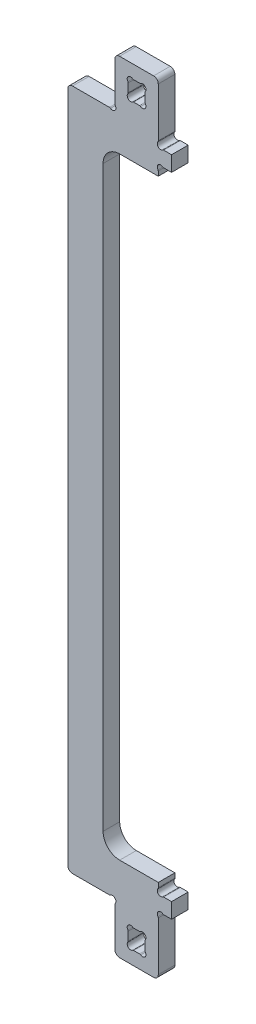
ISO-10303-21;
HEADER;
FILE_DESCRIPTION(('STEP AP214'),'2;1');
FILE_NAME('part.step','',(''),(''),'','','');
FILE_SCHEMA(('AUTOMOTIVE_DESIGN { 1 0 10303 214 1 1 1 1 }'));
ENDSEC;
DATA;
#1=APPLICATION_CONTEXT('core data for automotive mechanical design processes');
#2=APPLICATION_PROTOCOL_DEFINITION('international standard','automotive_design',2000,#1);
#3=PRODUCT_CONTEXT('',#1,'mechanical');
#4=PRODUCT('Part','Part','',(#3));
#5=PRODUCT_RELATED_PRODUCT_CATEGORY('part','',(#4));
#6=PRODUCT_DEFINITION_FORMATION('','',#4);
#7=PRODUCT_DEFINITION_CONTEXT('part definition',#1,'design');
#8=PRODUCT_DEFINITION('design','',#6,#7);
#9=PRODUCT_DEFINITION_SHAPE('','',#8);
#10=(LENGTH_UNIT() NAMED_UNIT(*) SI_UNIT(.MILLI.,.METRE.));
#11=(NAMED_UNIT(*) PLANE_ANGLE_UNIT() SI_UNIT($,.RADIAN.));
#12=(NAMED_UNIT(*) SI_UNIT($,.STERADIAN.) SOLID_ANGLE_UNIT());
#13=UNCERTAINTY_MEASURE_WITH_UNIT(LENGTH_MEASURE(1.E-05),#10,'distance_accuracy_value','');
#14=(GEOMETRIC_REPRESENTATION_CONTEXT(3) GLOBAL_UNCERTAINTY_ASSIGNED_CONTEXT((#13)) GLOBAL_UNIT_ASSIGNED_CONTEXT((#10,
#11,#12)) REPRESENTATION_CONTEXT('',''));
#15=CARTESIAN_POINT('',(0.,0.,0.));
#16=DIRECTION('',(0.,0.,1.));
#17=DIRECTION('',(1.,0.,0.));
#18=AXIS2_PLACEMENT_3D('',#15,#16,#17);
#19=CARTESIAN_POINT('',(73.2999999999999,-8.13104038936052,25.));
#20=DIRECTION('',(0.,0.,-1.));
#21=DIRECTION('',(-1.,0.,0.));
#22=AXIS2_PLACEMENT_3D('',#19,#20,#21);
#23=PLANE('',#22);
#24=DIRECTION('',(0.,-1.,0.));
#25=VECTOR('',#24,1.);
#26=CARTESIAN_POINT('',(0.,0.,25.));
#27=LINE('',#26,#25);
#28=CARTESIAN_POINT('',(0.,1018.66666666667,25.));
#29=VERTEX_POINT('',#28);
#30=CARTESIAN_POINT('',(0.,7.,25.));
#31=VERTEX_POINT('',#30);
#32=EDGE_CURVE('E985',#29,#31,#27,.T.);
#33=ORIENTED_EDGE('',*,*,#32,.T.);
#34=CARTESIAN_POINT('',(7.,7.,25.));
#35=DIRECTION('',(0.,0.,-1.));
#36=DIRECTION('',(-1.,0.,0.));
#37=AXIS2_PLACEMENT_3D('',#34,#35,#36);
#38=CIRCLE('',#37,7.);
#39=CARTESIAN_POINT('',(7.,0.,25.));
#40=VERTEX_POINT('',#39);
#41=EDGE_CURVE('E1103',#31,#40,#38,.F.);
#42=ORIENTED_EDGE('',*,*,#41,.T.);
#43=DIRECTION('',(1.,0.,0.));
#44=VECTOR('',#43,1.);
#45=CARTESIAN_POINT('',(62.6689596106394,0.,25.));
#46=LINE('',#45,#44);
#47=CARTESIAN_POINT('',(62.6689596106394,0.,25.));
#48=VERTEX_POINT('',#47);
#49=EDGE_CURVE('E988',#40,#48,#46,.T.);
#50=ORIENTED_EDGE('',*,*,#49,.T.);
#51=CARTESIAN_POINT('',(62.6689596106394,2.5,25.));
#52=DIRECTION('',(0.,0.,1.));
#53=DIRECTION('',(-1.,0.,0.));
#54=AXIS2_PLACEMENT_3D('',#51,#52,#53);
#55=CIRCLE('',#54,2.5);
#56=CARTESIAN_POINT('',(64.1573792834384,0.491366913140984,25.));
#57=VERTEX_POINT('',#56);
#58=EDGE_CURVE('E990',#48,#57,#55,.T.);
#59=ORIENTED_EDGE('',*,*,#58,.T.);
#60=CARTESIAN_POINT('',(67.1937554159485,-3.6062445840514,25.));
#61=DIRECTION('',(0.,0.,-1.));
#62=DIRECTION('',(1.,0.,0.));
#63=AXIS2_PLACEMENT_3D('',#60,#61,#62);
#64=CIRCLE('',#63,5.1);
#65=CARTESIAN_POINT('',(71.2913669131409,-6.64262071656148,25.));
#66=VERTEX_POINT('',#65);
#67=EDGE_CURVE('E992',#57,#66,#64,.T.);
#68=ORIENTED_EDGE('',*,*,#67,.T.);
#69=CARTESIAN_POINT('',(73.2999999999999,-8.13104038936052,25.));
#70=DIRECTION('',(0.,0.,1.));
#71=DIRECTION('',(-1.,0.,0.));
#72=AXIS2_PLACEMENT_3D('',#69,#70,#71);
#73=CIRCLE('',#72,2.50000000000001);
#74=CARTESIAN_POINT('',(70.7999999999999,-8.13104038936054,25.));
#75=VERTEX_POINT('',#74);
#76=EDGE_CURVE('E994',#66,#75,#73,.T.);
#77=ORIENTED_EDGE('',*,*,#76,.T.);
#78=DIRECTION('',(0.,-1.,0.));
#79=VECTOR('',#78,1.);
#80=CARTESIAN_POINT('',(70.7999999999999,-74.1666666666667,25.));
#81=LINE('',#80,#79);
#82=CARTESIAN_POINT('',(70.7999999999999,-67.1666666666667,25.));
#83=VERTEX_POINT('',#82);
#84=EDGE_CURVE('E951',#75,#83,#81,.T.);
#85=ORIENTED_EDGE('',*,*,#84,.T.);
#86=CARTESIAN_POINT('',(77.7999999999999,-67.1666666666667,25.));
#87=DIRECTION('',(0.,0.,-1.));
#88=DIRECTION('',(-1.,0.,0.));
#89=AXIS2_PLACEMENT_3D('',#86,#87,#88);
#90=CIRCLE('',#89,7.);
#91=CARTESIAN_POINT('',(77.7999999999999,-74.1666666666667,25.));
#92=VERTEX_POINT('',#91);
#93=EDGE_CURVE('E1100',#83,#92,#90,.F.);
#94=ORIENTED_EDGE('',*,*,#93,.T.);
#95=DIRECTION('',(1.,0.,0.));
#96=VECTOR('',#95,1.);
#97=CARTESIAN_POINT('',(70.7999999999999,-74.1666666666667,25.));
#98=LINE('',#97,#96);
#99=CARTESIAN_POINT('',(129.,-74.1666666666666,25.));
#100=VERTEX_POINT('',#99);
#101=EDGE_CURVE('E954',#92,#100,#98,.T.);
#102=ORIENTED_EDGE('',*,*,#101,.T.);
#103=CARTESIAN_POINT('',(129.,-67.1666666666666,25.));
#104=DIRECTION('',(0.,0.,-1.));
#105=DIRECTION('',(-1.,0.,0.));
#106=AXIS2_PLACEMENT_3D('',#103,#104,#105);
#107=CIRCLE('',#106,7.);
#108=CARTESIAN_POINT('',(136.,-67.1666666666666,25.));
#109=VERTEX_POINT('',#108);
#110=EDGE_CURVE('E48',#100,#109,#107,.F.);
#111=ORIENTED_EDGE('',*,*,#110,.T.);
#112=DIRECTION('',(0.,1.,0.));
#113=VECTOR('',#112,1.);
#114=CARTESIAN_POINT('',(136.,-74.1666666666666,25.));
#115=LINE('',#114,#113);
#116=CARTESIAN_POINT('',(136.,6.86895961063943,25.));
#117=VERTEX_POINT('',#116);
#118=EDGE_CURVE('E957',#109,#117,#115,.T.);
#119=ORIENTED_EDGE('',*,*,#118,.T.);
#120=CARTESIAN_POINT('',(133.5,6.86895961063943,25.));
#121=DIRECTION('',(0.,0.,1.));
#122=DIRECTION('',(-1.,0.,0.));
#123=AXIS2_PLACEMENT_3D('',#120,#121,#122);
#124=CIRCLE('',#123,2.50000000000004);
#125=CARTESIAN_POINT('',(135.508633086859,8.35737928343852,25.));
#126=VERTEX_POINT('',#125);
#127=EDGE_CURVE('E959',#117,#126,#124,.T.);
#128=ORIENTED_EDGE('',*,*,#127,.T.);
#129=CARTESIAN_POINT('',(139.606244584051,11.3937554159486,25.));
#130=DIRECTION('',(0.,0.,-1.));
#131=DIRECTION('',(1.,0.,0.));
#132=AXIS2_PLACEMENT_3D('',#129,#130,#131);
#133=CIRCLE('',#132,5.09999999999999);
#134=CARTESIAN_POINT('',(142.642620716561,15.491366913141,25.));
#135=VERTEX_POINT('',#134);
#136=EDGE_CURVE('E961',#126,#135,#133,.T.);
#137=ORIENTED_EDGE('',*,*,#136,.T.);
#138=CARTESIAN_POINT('',(144.13104038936,17.5,25.));
#139=DIRECTION('',(0.,0.,1.));
#140=DIRECTION('',(1.,0.,0.));
#141=AXIS2_PLACEMENT_3D('',#138,#139,#140);
#142=CIRCLE('',#141,2.49999999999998);
#143=CARTESIAN_POINT('',(144.13104038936,15.,25.));
#144=VERTEX_POINT('',#143);
#145=EDGE_CURVE('E963',#135,#144,#142,.T.);
#146=ORIENTED_EDGE('',*,*,#145,.T.);
#147=DIRECTION('',(1.,0.,0.));
#148=VECTOR('',#147,1.);
#149=CARTESIAN_POINT('',(144.13104038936,15.,25.));
#150=LINE('',#149,#148);
#151=CARTESIAN_POINT('',(156.,15.,25.));
#152=VERTEX_POINT('',#151);
#153=EDGE_CURVE('E965',#144,#152,#150,.T.);
#154=ORIENTED_EDGE('',*,*,#153,.T.);
#155=DIRECTION('',(0.,1.,0.));
#156=VECTOR('',#155,1.);
#157=CARTESIAN_POINT('',(156.,15.,25.));
#158=LINE('',#157,#156);
#159=CARTESIAN_POINT('',(156.,38.,25.));
#160=VERTEX_POINT('',#159);
#161=EDGE_CURVE('E967',#152,#160,#158,.T.);
#162=ORIENTED_EDGE('',*,*,#161,.T.);
#163=DIRECTION('',(-1.,0.,0.));
#164=VECTOR('',#163,1.);
#165=CARTESIAN_POINT('',(144.13104038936,38.,25.));
#166=LINE('',#165,#164);
#167=CARTESIAN_POINT('',(144.13104038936,38.,25.));
#168=VERTEX_POINT('',#167);
#169=EDGE_CURVE('E969',#160,#168,#166,.T.);
#170=ORIENTED_EDGE('',*,*,#169,.T.);
#171=CARTESIAN_POINT('',(144.13104038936,35.5,25.));
#172=DIRECTION('',(0.,0.,1.));
#173=DIRECTION('',(-1.,0.,0.));
#174=AXIS2_PLACEMENT_3D('',#171,#172,#173);
#175=CIRCLE('',#174,2.49999999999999);
#176=CARTESIAN_POINT('',(142.642620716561,37.508633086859,25.));
#177=VERTEX_POINT('',#176);
#178=EDGE_CURVE('E971',#168,#177,#175,.T.);
#179=ORIENTED_EDGE('',*,*,#178,.T.);
#180=CARTESIAN_POINT('',(139.606244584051,41.6062445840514,25.));
#181=DIRECTION('',(0.,0.,-1.));
#182=DIRECTION('',(-1.,0.,0.));
#183=AXIS2_PLACEMENT_3D('',#180,#181,#182);
#184=CIRCLE('',#183,5.1);
#185=CARTESIAN_POINT('',(135.508633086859,44.6426207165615,25.));
#186=VERTEX_POINT('',#185);
#187=EDGE_CURVE('E973',#177,#186,#184,.T.);
#188=ORIENTED_EDGE('',*,*,#187,.T.);
#189=CARTESIAN_POINT('',(133.5,46.1310403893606,25.));
#190=DIRECTION('',(0.,0.,1.));
#191=DIRECTION('',(1.,0.,0.));
#192=AXIS2_PLACEMENT_3D('',#189,#190,#191);
#193=CIRCLE('',#192,2.50000000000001);
#194=CARTESIAN_POINT('',(136.,46.1310403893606,25.));
#195=VERTEX_POINT('',#194);
#196=EDGE_CURVE('E975',#186,#195,#193,.T.);
#197=ORIENTED_EDGE('',*,*,#196,.T.);
#198=DIRECTION('',(0.,1.,0.));
#199=VECTOR('',#198,1.);
#200=CARTESIAN_POINT('',(136.,53.,25.));
#201=LINE('',#200,#199);
#202=CARTESIAN_POINT('',(136.,53.,25.));
#203=VERTEX_POINT('',#202);
#204=EDGE_CURVE('E977',#195,#203,#201,.T.);
#205=ORIENTED_EDGE('',*,*,#204,.T.);
#206=DIRECTION('',(-1.,0.,0.));
#207=VECTOR('',#206,1.);
#208=CARTESIAN_POINT('',(78.,53.,25.));
#209=LINE('',#208,#207);
#210=CARTESIAN_POINT('',(78.,53.,25.));
#211=VERTEX_POINT('',#210);
#212=EDGE_CURVE('E979',#203,#211,#209,.T.);
#213=ORIENTED_EDGE('',*,*,#212,.T.);
#214=CARTESIAN_POINT('',(78.,78.,25.));
#215=DIRECTION('',(0.,0.,-1.));
#216=DIRECTION('',(1.,0.,0.));
#217=AXIS2_PLACEMENT_3D('',#214,#215,#216);
#218=CIRCLE('',#217,25.);
#219=CARTESIAN_POINT('',(53.,78.,25.));
#220=VERTEX_POINT('',#219);
#221=EDGE_CURVE('E981',#211,#220,#218,.T.);
#222=ORIENTED_EDGE('',*,*,#221,.T.);
#223=DIRECTION('',(0.,1.,0.));
#224=VECTOR('',#223,1.);
#225=CARTESIAN_POINT('',(53.,78.,25.));
#226=LINE('',#225,#224);
#227=CARTESIAN_POINT('',(53.,947.666666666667,25.));
#228=VERTEX_POINT('',#227);
#229=EDGE_CURVE('E983',#220,#228,#226,.T.);
#230=ORIENTED_EDGE('',*,*,#229,.T.);
#231=CARTESIAN_POINT('',(78.,947.666666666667,25.));
#232=DIRECTION('',(0.,0.,1.));
#233=DIRECTION('',(1.,0.,0.));
#234=AXIS2_PLACEMENT_3D('',#231,#232,#233);
#235=CIRCLE('',#234,25.);
#236=CARTESIAN_POINT('',(78.,972.666666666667,25.));
#237=VERTEX_POINT('',#236);
#238=EDGE_CURVE('E699',#237,#228,#235,.T.);
#239=ORIENTED_EDGE('',*,*,#238,.F.);
#240=DIRECTION('',(-1.,0.,0.));
#241=VECTOR('',#240,1.);
#242=CARTESIAN_POINT('',(78.,972.666666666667,25.));
#243=LINE('',#242,#241);
#244=CARTESIAN_POINT('',(136.,972.666666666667,25.));
#245=VERTEX_POINT('',#244);
#246=EDGE_CURVE('E696',#245,#237,#243,.T.);
#247=ORIENTED_EDGE('',*,*,#246,.F.);
#248=DIRECTION('',(0.,-1.,0.));
#249=VECTOR('',#248,1.);
#250=CARTESIAN_POINT('',(136.,972.666666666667,25.));
#251=LINE('',#250,#249);
#252=CARTESIAN_POINT('',(136.,979.535626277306,25.));
#253=VERTEX_POINT('',#252);
#254=EDGE_CURVE('E693',#253,#245,#251,.T.);
#255=ORIENTED_EDGE('',*,*,#254,.F.);
#256=CARTESIAN_POINT('',(133.5,979.535626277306,25.));
#257=DIRECTION('',(0.,0.,-1.));
#258=DIRECTION('',(1.,0.,0.));
#259=AXIS2_PLACEMENT_3D('',#256,#257,#258);
#260=CIRCLE('',#259,2.50000000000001);
#261=CARTESIAN_POINT('',(135.508633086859,981.024045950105,25.));
#262=VERTEX_POINT('',#261);
#263=EDGE_CURVE('E690',#262,#253,#260,.T.);
#264=ORIENTED_EDGE('',*,*,#263,.F.);
#265=CARTESIAN_POINT('',(139.606244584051,984.060422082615,25.));
#266=DIRECTION('',(0.,0.,1.));
#267=DIRECTION('',(-1.,0.,0.));
#268=AXIS2_PLACEMENT_3D('',#265,#266,#267);
#269=CIRCLE('',#268,5.1);
#270=CARTESIAN_POINT('',(142.642620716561,988.158033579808,25.));
#271=VERTEX_POINT('',#270);
#272=EDGE_CURVE('E687',#271,#262,#269,.T.);
#273=ORIENTED_EDGE('',*,*,#272,.F.);
#274=CARTESIAN_POINT('',(144.13104038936,990.166666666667,25.));
#275=DIRECTION('',(0.,0.,-1.));
#276=DIRECTION('',(-1.,0.,0.));
#277=AXIS2_PLACEMENT_3D('',#274,#275,#276);
#278=CIRCLE('',#277,2.49999999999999);
#279=CARTESIAN_POINT('',(144.13104038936,987.666666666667,25.));
#280=VERTEX_POINT('',#279);
#281=EDGE_CURVE('E684',#280,#271,#278,.T.);
#282=ORIENTED_EDGE('',*,*,#281,.F.);
#283=DIRECTION('',(-1.,0.,0.));
#284=VECTOR('',#283,1.);
#285=CARTESIAN_POINT('',(144.13104038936,987.666666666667,25.));
#286=LINE('',#285,#284);
#287=CARTESIAN_POINT('',(156.,987.666666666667,25.));
#288=VERTEX_POINT('',#287);
#289=EDGE_CURVE('E681',#288,#280,#286,.T.);
#290=ORIENTED_EDGE('',*,*,#289,.F.);
#291=DIRECTION('',(0.,-1.,0.));
#292=VECTOR('',#291,1.);
#293=CARTESIAN_POINT('',(156.,1010.66666666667,25.));
#294=LINE('',#293,#292);
#295=CARTESIAN_POINT('',(156.,1010.66666666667,25.));
#296=VERTEX_POINT('',#295);
#297=EDGE_CURVE('E678',#296,#288,#294,.T.);
#298=ORIENTED_EDGE('',*,*,#297,.F.);
#299=DIRECTION('',(1.,0.,0.));
#300=VECTOR('',#299,1.);
#301=CARTESIAN_POINT('',(144.13104038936,1010.66666666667,25.));
#302=LINE('',#301,#300);
#303=CARTESIAN_POINT('',(144.13104038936,1010.66666666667,25.));
#304=VERTEX_POINT('',#303);
#305=EDGE_CURVE('E675',#304,#296,#302,.T.);
#306=ORIENTED_EDGE('',*,*,#305,.F.);
#307=CARTESIAN_POINT('',(144.13104038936,1008.16666666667,25.));
#308=DIRECTION('',(0.,0.,-1.));
#309=DIRECTION('',(1.,0.,0.));
#310=AXIS2_PLACEMENT_3D('',#307,#308,#309);
#311=CIRCLE('',#310,2.49999999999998);
#312=CARTESIAN_POINT('',(142.642620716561,1010.17529975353,25.));
#313=VERTEX_POINT('',#312);
#314=EDGE_CURVE('E672',#313,#304,#311,.T.);
#315=ORIENTED_EDGE('',*,*,#314,.F.);
#316=CARTESIAN_POINT('',(139.606244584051,1014.27291125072,25.));
#317=DIRECTION('',(0.,0.,1.));
#318=DIRECTION('',(1.,0.,0.));
#319=AXIS2_PLACEMENT_3D('',#316,#317,#318);
#320=CIRCLE('',#319,5.09999999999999);
#321=CARTESIAN_POINT('',(135.508633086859,1017.30928738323,25.));
#322=VERTEX_POINT('',#321);
#323=EDGE_CURVE('E669',#322,#313,#320,.T.);
#324=ORIENTED_EDGE('',*,*,#323,.F.);
#325=CARTESIAN_POINT('',(133.5,1018.79770705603,25.));
#326=DIRECTION('',(0.,0.,-1.));
#327=DIRECTION('',(-1.,0.,0.));
#328=AXIS2_PLACEMENT_3D('',#325,#326,#327);
#329=CIRCLE('',#328,2.50000000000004);
#330=CARTESIAN_POINT('',(136.,1018.79770705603,25.));
#331=VERTEX_POINT('',#330);
#332=EDGE_CURVE('E666',#331,#322,#329,.T.);
#333=ORIENTED_EDGE('',*,*,#332,.F.);
#334=DIRECTION('',(0.,-1.,0.));
#335=VECTOR('',#334,1.);
#336=CARTESIAN_POINT('',(136.,1099.83333333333,25.));
#337=LINE('',#336,#335);
#338=CARTESIAN_POINT('',(136.,1092.83333333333,25.));
#339=VERTEX_POINT('',#338);
#340=EDGE_CURVE('E663',#339,#331,#337,.T.);
#341=ORIENTED_EDGE('',*,*,#340,.F.);
#342=CARTESIAN_POINT('',(129.,1092.83333333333,25.));
#343=DIRECTION('',(0.,0.,1.));
#344=DIRECTION('',(-1.,0.,0.));
#345=AXIS2_PLACEMENT_3D('',#342,#343,#344);
#346=CIRCLE('',#345,7.);
#347=CARTESIAN_POINT('',(129.,1099.83333333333,25.));
#348=VERTEX_POINT('',#347);
#349=EDGE_CURVE('E821',#348,#339,#346,.F.);
#350=ORIENTED_EDGE('',*,*,#349,.F.);
#351=DIRECTION('',(1.,0.,0.));
#352=VECTOR('',#351,1.);
#353=CARTESIAN_POINT('',(70.7999999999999,1099.83333333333,25.));
#354=LINE('',#353,#352);
#355=CARTESIAN_POINT('',(77.7999999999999,1099.83333333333,25.));
#356=VERTEX_POINT('',#355);
#357=EDGE_CURVE('E659',#356,#348,#354,.T.);
#358=ORIENTED_EDGE('',*,*,#357,.F.);
#359=CARTESIAN_POINT('',(77.7999999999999,1092.83333333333,25.));
#360=DIRECTION('',(0.,0.,1.));
#361=DIRECTION('',(-1.,0.,0.));
#362=AXIS2_PLACEMENT_3D('',#359,#360,#361);
#363=CIRCLE('',#362,7.);
#364=CARTESIAN_POINT('',(70.7999999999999,1092.83333333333,25.));
#365=VERTEX_POINT('',#364);
#366=EDGE_CURVE('E818',#365,#356,#363,.F.);
#367=ORIENTED_EDGE('',*,*,#366,.F.);
#368=DIRECTION('',(0.,1.,0.));
#369=VECTOR('',#368,1.);
#370=CARTESIAN_POINT('',(70.7999999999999,1099.83333333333,25.));
#371=LINE('',#370,#369);
#372=CARTESIAN_POINT('',(70.7999999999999,1033.79770705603,25.));
#373=VERTEX_POINT('',#372);
#374=EDGE_CURVE('E656',#373,#365,#371,.T.);
#375=ORIENTED_EDGE('',*,*,#374,.F.);
#376=CARTESIAN_POINT('',(73.2999999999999,1033.79770705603,25.));
#377=DIRECTION('',(0.,0.,-1.));
#378=DIRECTION('',(-1.,0.,0.));
#379=AXIS2_PLACEMENT_3D('',#376,#377,#378);
#380=CIRCLE('',#379,2.50000000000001);
#381=CARTESIAN_POINT('',(71.2913669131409,1032.30928738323,25.));
#382=VERTEX_POINT('',#381);
#383=EDGE_CURVE('E711',#382,#373,#380,.T.);
#384=ORIENTED_EDGE('',*,*,#383,.F.);
#385=CARTESIAN_POINT('',(67.1937554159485,1029.27291125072,25.));
#386=DIRECTION('',(0.,0.,1.));
#387=DIRECTION('',(1.,0.,0.));
#388=AXIS2_PLACEMENT_3D('',#385,#386,#387);
#389=CIRCLE('',#388,5.1);
#390=CARTESIAN_POINT('',(64.1573792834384,1025.17529975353,25.));
#391=VERTEX_POINT('',#390);
#392=EDGE_CURVE('E708',#391,#382,#389,.T.);
#393=ORIENTED_EDGE('',*,*,#392,.F.);
#394=CARTESIAN_POINT('',(62.6689596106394,1023.16666666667,25.));
#395=DIRECTION('',(0.,0.,-1.));
#396=DIRECTION('',(-1.,0.,0.));
#397=AXIS2_PLACEMENT_3D('',#394,#395,#396);
#398=CIRCLE('',#397,2.5);
#399=CARTESIAN_POINT('',(62.6689596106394,1025.66666666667,25.));
#400=VERTEX_POINT('',#399);
#401=EDGE_CURVE('E705',#400,#391,#398,.T.);
#402=ORIENTED_EDGE('',*,*,#401,.F.);
#403=DIRECTION('',(1.,0.,0.));
#404=VECTOR('',#403,1.);
#405=CARTESIAN_POINT('',(62.6689596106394,1025.66666666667,25.));
#406=LINE('',#405,#404);
#407=CARTESIAN_POINT('',(7.,1025.66666666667,25.));
#408=VERTEX_POINT('',#407);
#409=EDGE_CURVE('E702',#408,#400,#406,.T.);
#410=ORIENTED_EDGE('',*,*,#409,.F.);
#411=CARTESIAN_POINT('',(7.,1018.66666666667,25.));
#412=DIRECTION('',(0.,0.,1.));
#413=DIRECTION('',(-1.,0.,0.));
#414=AXIS2_PLACEMENT_3D('',#411,#412,#413);
#415=CIRCLE('',#414,7.);
#416=EDGE_CURVE('E824',#29,#408,#415,.F.);
#417=ORIENTED_EDGE('',*,*,#416,.F.);
#418=EDGE_LOOP('',(#33,#42,#50,#59,#68,#77,#85,#94,#102,#111,#119,#128,#137,#146,#154,#162,#170,
#179,#188,#197,#205,#213,#222,#230,#239,#247,#255,#264,#273,#282,#290,#298,#306,#315,#324,#333,
#341,#350,#358,#367,#375,#384,#393,#402,#410,#417));
#419=FACE_BOUND('',#418,.T.);
#420=CARTESIAN_POINT('',(88.2999999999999,-46.0356262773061,25.));
#421=DIRECTION('',(0.,0.,-1.));
#422=DIRECTION('',(1.,0.,0.));
#423=AXIS2_PLACEMENT_3D('',#420,#421,#422);
#424=CIRCLE('',#423,2.5);
#425=CARTESIAN_POINT('',(90.7999999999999,-46.0356262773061,25.));
#426=VERTEX_POINT('',#425);
#427=CARTESIAN_POINT('',(90.3086330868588,-47.5240459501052,25.));
#428=VERTEX_POINT('',#427);
#429=EDGE_CURVE('E836',#426,#428,#424,.T.);
#430=ORIENTED_EDGE('',*,*,#429,.F.);
#431=DIRECTION('',(0.,-1.,0.));
#432=VECTOR('',#431,1.);
#433=CARTESIAN_POINT('',(90.7999999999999,-33.1310403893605,25.));
#434=LINE('',#433,#432);
#435=CARTESIAN_POINT('',(90.7999999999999,-33.1310403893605,25.));
#436=VERTEX_POINT('',#435);
#437=EDGE_CURVE('E868',#436,#426,#434,.T.);
#438=ORIENTED_EDGE('',*,*,#437,.F.);
#439=CARTESIAN_POINT('',(88.2999999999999,-33.1310403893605,25.));
#440=DIRECTION('',(0.,0.,-1.));
#441=DIRECTION('',(-1.,0.,0.));
#442=AXIS2_PLACEMENT_3D('',#439,#440,#441);
#443=CIRCLE('',#442,2.5);
#444=CARTESIAN_POINT('',(90.3086330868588,-31.6426207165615,25.));
#445=VERTEX_POINT('',#444);
#446=EDGE_CURVE('E865',#445,#436,#443,.T.);
#447=ORIENTED_EDGE('',*,*,#446,.F.);
#448=CARTESIAN_POINT('',(94.4062445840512,-28.6062445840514,25.));
#449=DIRECTION('',(0.,0.,1.));
#450=DIRECTION('',(-1.,0.,0.));
#451=AXIS2_PLACEMENT_3D('',#448,#449,#450);
#452=CIRCLE('',#451,5.1);
#453=CARTESIAN_POINT('',(97.4426207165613,-24.508633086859,25.));
#454=VERTEX_POINT('',#453);
#455=EDGE_CURVE('E863',#454,#445,#452,.T.);
#456=ORIENTED_EDGE('',*,*,#455,.F.);
#457=CARTESIAN_POINT('',(98.9310403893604,-22.5,25.));
#458=DIRECTION('',(0.,0.,-1.));
#459=DIRECTION('',(1.,0.,0.));
#460=AXIS2_PLACEMENT_3D('',#457,#458,#459);
#461=CIRCLE('',#460,2.5);
#462=CARTESIAN_POINT('',(98.9310403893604,-25.,25.));
#463=VERTEX_POINT('',#462);
#464=EDGE_CURVE('E861',#463,#454,#461,.T.);
#465=ORIENTED_EDGE('',*,*,#464,.F.);
#466=DIRECTION('',(-1.,0.,0.));
#467=VECTOR('',#466,1.);
#468=CARTESIAN_POINT('',(98.9310403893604,-25.,25.));
#469=LINE('',#468,#467);
#470=CARTESIAN_POINT('',(107.868959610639,-25.,25.));
#471=VERTEX_POINT('',#470);
#472=EDGE_CURVE('E859',#471,#463,#469,.T.);
#473=ORIENTED_EDGE('',*,*,#472,.F.);
#474=CARTESIAN_POINT('',(107.868959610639,-22.5,25.));
#475=DIRECTION('',(0.,0.,-1.));
#476=DIRECTION('',(-1.,0.,0.));
#477=AXIS2_PLACEMENT_3D('',#474,#475,#476);
#478=CIRCLE('',#477,2.5);
#479=CARTESIAN_POINT('',(109.357379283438,-24.508633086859,25.));
#480=VERTEX_POINT('',#479);
#481=EDGE_CURVE('E857',#480,#471,#478,.T.);
#482=ORIENTED_EDGE('',*,*,#481,.F.);
#483=CARTESIAN_POINT('',(112.393755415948,-28.6062445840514,25.));
#484=DIRECTION('',(0.,0.,1.));
#485=DIRECTION('',(1.,0.,0.));
#486=AXIS2_PLACEMENT_3D('',#483,#484,#485);
#487=CIRCLE('',#486,5.1);
#488=CARTESIAN_POINT('',(116.491366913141,-31.6426207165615,25.));
#489=VERTEX_POINT('',#488);
#490=EDGE_CURVE('E855',#489,#480,#487,.T.);
#491=ORIENTED_EDGE('',*,*,#490,.F.);
#492=CARTESIAN_POINT('',(118.5,-33.1310403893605,25.));
#493=DIRECTION('',(0.,0.,-1.));
#494=DIRECTION('',(1.,0.,0.));
#495=AXIS2_PLACEMENT_3D('',#492,#493,#494);
#496=CIRCLE('',#495,2.5);
#497=CARTESIAN_POINT('',(116.,-33.1310403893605,25.));
#498=VERTEX_POINT('',#497);
#499=EDGE_CURVE('E853',#498,#489,#496,.T.);
#500=ORIENTED_EDGE('',*,*,#499,.F.);
#501=DIRECTION('',(0.,1.,0.));
#502=VECTOR('',#501,1.);
#503=CARTESIAN_POINT('',(116.,-33.1310403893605,25.));
#504=LINE('',#503,#502);
#505=CARTESIAN_POINT('',(116.,-46.0356262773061,25.));
#506=VERTEX_POINT('',#505);
#507=EDGE_CURVE('E851',#506,#498,#504,.T.);
#508=ORIENTED_EDGE('',*,*,#507,.F.);
#509=CARTESIAN_POINT('',(118.5,-46.0356262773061,25.));
#510=DIRECTION('',(0.,0.,-1.));
#511=DIRECTION('',(-1.,0.,0.));
#512=AXIS2_PLACEMENT_3D('',#509,#510,#511);
#513=CIRCLE('',#512,2.5);
#514=CARTESIAN_POINT('',(116.491366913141,-47.5240459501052,25.));
#515=VERTEX_POINT('',#514);
#516=EDGE_CURVE('E849',#515,#506,#513,.T.);
#517=ORIENTED_EDGE('',*,*,#516,.F.);
#518=CARTESIAN_POINT('',(112.393755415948,-50.5604220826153,25.));
#519=DIRECTION('',(0.,0.,1.));
#520=DIRECTION('',(-1.,0.,0.));
#521=AXIS2_PLACEMENT_3D('',#518,#519,#520);
#522=CIRCLE('',#521,5.1);
#523=CARTESIAN_POINT('',(109.357379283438,-54.6580335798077,25.));
#524=VERTEX_POINT('',#523);
#525=EDGE_CURVE('E847',#524,#515,#522,.T.);
#526=ORIENTED_EDGE('',*,*,#525,.F.);
#527=CARTESIAN_POINT('',(107.868959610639,-56.6666666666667,25.));
#528=DIRECTION('',(0.,0.,-1.));
#529=DIRECTION('',(1.,0.,0.));
#530=AXIS2_PLACEMENT_3D('',#527,#528,#529);
#531=CIRCLE('',#530,2.5);
#532=CARTESIAN_POINT('',(107.868959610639,-54.1666666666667,25.));
#533=VERTEX_POINT('',#532);
#534=EDGE_CURVE('E845',#533,#524,#531,.T.);
#535=ORIENTED_EDGE('',*,*,#534,.F.);
#536=DIRECTION('',(1.,0.,0.));
#537=VECTOR('',#536,1.);
#538=CARTESIAN_POINT('',(98.9310403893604,-54.1666666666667,25.));
#539=LINE('',#538,#537);
#540=CARTESIAN_POINT('',(98.9310403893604,-54.1666666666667,25.));
#541=VERTEX_POINT('',#540);
#542=EDGE_CURVE('E843',#541,#533,#539,.T.);
#543=ORIENTED_EDGE('',*,*,#542,.F.);
#544=CARTESIAN_POINT('',(98.9310403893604,-56.6666666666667,25.));
#545=DIRECTION('',(0.,0.,-1.));
#546=DIRECTION('',(-1.,0.,0.));
#547=AXIS2_PLACEMENT_3D('',#544,#545,#546);
#548=CIRCLE('',#547,2.5);
#549=CARTESIAN_POINT('',(97.4426207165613,-54.6580335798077,25.));
#550=VERTEX_POINT('',#549);
#551=EDGE_CURVE('E841',#550,#541,#548,.T.);
#552=ORIENTED_EDGE('',*,*,#551,.F.);
#553=CARTESIAN_POINT('',(94.4062445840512,-50.5604220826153,25.));
#554=DIRECTION('',(0.,0.,1.));
#555=DIRECTION('',(1.,0.,0.));
#556=AXIS2_PLACEMENT_3D('',#553,#554,#555);
#557=CIRCLE('',#556,5.1);
#558=EDGE_CURVE('E838',#428,#550,#557,.T.);
#559=ORIENTED_EDGE('',*,*,#558,.F.);
#560=EDGE_LOOP('',(#430,#438,#447,#456,#465,#473,#482,#491,#500,#508,#517,#526,#535,#543,#552,#559));
#561=FACE_BOUND('',#560,.T.);
#562=CARTESIAN_POINT('',(88.2999999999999,1071.70229294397,25.));
#563=DIRECTION('',(0.,0.,1.));
#564=DIRECTION('',(1.,0.,0.));
#565=AXIS2_PLACEMENT_3D('',#562,#563,#564);
#566=CIRCLE('',#565,2.5);
#567=CARTESIAN_POINT('',(90.7999999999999,1071.70229294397,25.));
#568=VERTEX_POINT('',#567);
#569=CARTESIAN_POINT('',(90.3086330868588,1073.19071261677,25.));
#570=VERTEX_POINT('',#569);
#571=EDGE_CURVE('E522',#568,#570,#566,.T.);
#572=ORIENTED_EDGE('',*,*,#571,.T.);
#573=CARTESIAN_POINT('',(94.4062445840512,1076.22708874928,25.));
#574=DIRECTION('',(0.,0.,-1.));
#575=DIRECTION('',(1.,0.,0.));
#576=AXIS2_PLACEMENT_3D('',#573,#574,#575);
#577=CIRCLE('',#576,5.1);
#578=CARTESIAN_POINT('',(97.4426207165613,1080.32470024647,25.));
#579=VERTEX_POINT('',#578);
#580=EDGE_CURVE('E532',#570,#579,#577,.T.);
#581=ORIENTED_EDGE('',*,*,#580,.T.);
#582=CARTESIAN_POINT('',(98.9310403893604,1082.33333333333,25.));
#583=DIRECTION('',(0.,0.,1.));
#584=DIRECTION('',(-1.,0.,0.));
#585=AXIS2_PLACEMENT_3D('',#582,#583,#584);
#586=CIRCLE('',#585,2.5);
#587=CARTESIAN_POINT('',(98.9310403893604,1079.83333333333,25.));
#588=VERTEX_POINT('',#587);
#589=EDGE_CURVE('E537',#579,#588,#586,.T.);
#590=ORIENTED_EDGE('',*,*,#589,.T.);
#591=DIRECTION('',(1.,0.,0.));
#592=VECTOR('',#591,1.);
#593=CARTESIAN_POINT('',(98.9310403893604,1079.83333333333,25.));
#594=LINE('',#593,#592);
#595=CARTESIAN_POINT('',(107.868959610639,1079.83333333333,25.));
#596=VERTEX_POINT('',#595);
#597=EDGE_CURVE('E550',#588,#596,#594,.T.);
#598=ORIENTED_EDGE('',*,*,#597,.T.);
#599=CARTESIAN_POINT('',(107.868959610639,1082.33333333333,25.));
#600=DIRECTION('',(0.,0.,1.));
#601=DIRECTION('',(1.,0.,0.));
#602=AXIS2_PLACEMENT_3D('',#599,#600,#601);
#603=CIRCLE('',#602,2.5);
#604=CARTESIAN_POINT('',(109.357379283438,1080.32470024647,25.));
#605=VERTEX_POINT('',#604);
#606=EDGE_CURVE('E553',#596,#605,#603,.T.);
#607=ORIENTED_EDGE('',*,*,#606,.T.);
#608=CARTESIAN_POINT('',(112.393755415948,1076.22708874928,25.));
#609=DIRECTION('',(0.,0.,-1.));
#610=DIRECTION('',(-1.,0.,0.));
#611=AXIS2_PLACEMENT_3D('',#608,#609,#610);
#612=CIRCLE('',#611,5.1);
#613=CARTESIAN_POINT('',(116.491366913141,1073.19071261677,25.));
#614=VERTEX_POINT('',#613);
#615=EDGE_CURVE('E556',#605,#614,#612,.T.);
#616=ORIENTED_EDGE('',*,*,#615,.T.);
#617=CARTESIAN_POINT('',(118.5,1071.70229294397,25.));
#618=DIRECTION('',(0.,0.,1.));
#619=DIRECTION('',(-1.,0.,0.));
#620=AXIS2_PLACEMENT_3D('',#617,#618,#619);
#621=CIRCLE('',#620,2.5);
#622=CARTESIAN_POINT('',(116.,1071.70229294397,25.));
#623=VERTEX_POINT('',#622);
#624=EDGE_CURVE('E559',#614,#623,#621,.T.);
#625=ORIENTED_EDGE('',*,*,#624,.T.);
#626=DIRECTION('',(0.,-1.,0.));
#627=VECTOR('',#626,1.);
#628=CARTESIAN_POINT('',(116.,1058.79770705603,25.));
#629=LINE('',#628,#627);
#630=CARTESIAN_POINT('',(116.,1058.79770705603,25.));
#631=VERTEX_POINT('',#630);
#632=EDGE_CURVE('E562',#623,#631,#629,.T.);
#633=ORIENTED_EDGE('',*,*,#632,.T.);
#634=CARTESIAN_POINT('',(118.5,1058.79770705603,25.));
#635=DIRECTION('',(0.,0.,1.));
#636=DIRECTION('',(1.,0.,0.));
#637=AXIS2_PLACEMENT_3D('',#634,#635,#636);
#638=CIRCLE('',#637,2.5);
#639=CARTESIAN_POINT('',(116.491366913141,1057.30928738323,25.));
#640=VERTEX_POINT('',#639);
#641=EDGE_CURVE('E565',#631,#640,#638,.T.);
#642=ORIENTED_EDGE('',*,*,#641,.T.);
#643=CARTESIAN_POINT('',(112.393755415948,1054.27291125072,25.));
#644=DIRECTION('',(0.,0.,-1.));
#645=DIRECTION('',(1.,0.,0.));
#646=AXIS2_PLACEMENT_3D('',#643,#644,#645);
#647=CIRCLE('',#646,5.1);
#648=CARTESIAN_POINT('',(109.357379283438,1050.17529975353,25.));
#649=VERTEX_POINT('',#648);
#650=EDGE_CURVE('E568',#640,#649,#647,.T.);
#651=ORIENTED_EDGE('',*,*,#650,.T.);
#652=CARTESIAN_POINT('',(107.868959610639,1048.16666666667,25.));
#653=DIRECTION('',(0.,0.,1.));
#654=DIRECTION('',(-1.,0.,0.));
#655=AXIS2_PLACEMENT_3D('',#652,#653,#654);
#656=CIRCLE('',#655,2.5);
#657=CARTESIAN_POINT('',(107.868959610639,1050.66666666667,25.));
#658=VERTEX_POINT('',#657);
#659=EDGE_CURVE('E571',#649,#658,#656,.T.);
#660=ORIENTED_EDGE('',*,*,#659,.T.);
#661=DIRECTION('',(-1.,0.,0.));
#662=VECTOR('',#661,1.);
#663=CARTESIAN_POINT('',(98.9310403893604,1050.66666666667,25.));
#664=LINE('',#663,#662);
#665=CARTESIAN_POINT('',(98.9310403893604,1050.66666666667,25.));
#666=VERTEX_POINT('',#665);
#667=EDGE_CURVE('E574',#658,#666,#664,.T.);
#668=ORIENTED_EDGE('',*,*,#667,.T.);
#669=CARTESIAN_POINT('',(98.9310403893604,1048.16666666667,25.));
#670=DIRECTION('',(0.,0.,1.));
#671=DIRECTION('',(1.,0.,0.));
#672=AXIS2_PLACEMENT_3D('',#669,#670,#671);
#673=CIRCLE('',#672,2.5);
#674=CARTESIAN_POINT('',(97.4426207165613,1050.17529975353,25.));
#675=VERTEX_POINT('',#674);
#676=EDGE_CURVE('E577',#666,#675,#673,.T.);
#677=ORIENTED_EDGE('',*,*,#676,.T.);
#678=CARTESIAN_POINT('',(94.4062445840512,1054.27291125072,25.));
#679=DIRECTION('',(0.,0.,-1.));
#680=DIRECTION('',(-1.,0.,0.));
#681=AXIS2_PLACEMENT_3D('',#678,#679,#680);
#682=CIRCLE('',#681,5.1);
#683=CARTESIAN_POINT('',(90.3086330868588,1057.30928738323,25.));
#684=VERTEX_POINT('',#683);
#685=EDGE_CURVE('E580',#675,#684,#682,.T.);
#686=ORIENTED_EDGE('',*,*,#685,.T.);
#687=CARTESIAN_POINT('',(88.2999999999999,1058.79770705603,25.));
#688=DIRECTION('',(0.,0.,1.));
#689=DIRECTION('',(-1.,0.,0.));
#690=AXIS2_PLACEMENT_3D('',#687,#688,#689);
#691=CIRCLE('',#690,2.5);
#692=CARTESIAN_POINT('',(90.7999999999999,1058.79770705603,25.));
#693=VERTEX_POINT('',#692);
#694=EDGE_CURVE('E583',#684,#693,#691,.T.);
#695=ORIENTED_EDGE('',*,*,#694,.T.);
#696=DIRECTION('',(0.,1.,0.));
#697=VECTOR('',#696,1.);
#698=CARTESIAN_POINT('',(90.7999999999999,1058.79770705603,25.));
#699=LINE('',#698,#697);
#700=EDGE_CURVE('E542',#693,#568,#699,.T.);
#701=ORIENTED_EDGE('',*,*,#700,.T.);
#702=EDGE_LOOP('',(#572,#581,#590,#598,#607,#616,#625,#633,#642,#651,#660,#668,#677,#686,#695,#701));
#703=FACE_BOUND('',#702,.T.);
#704=ADVANCED_FACE('F33',(#419,#561,#703),#23,.F.);
#705=CARTESIAN_POINT('',(73.2999999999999,-8.13104038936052,0.));
#706=DIRECTION('',(0.,0.,-1.));
#707=DIRECTION('',(-1.,0.,0.));
#708=AXIS2_PLACEMENT_3D('',#705,#706,#707);
#709=PLANE('',#708);
#710=DIRECTION('',(1.,0.,0.));
#711=VECTOR('',#710,1.);
#712=CARTESIAN_POINT('',(62.6689596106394,0.,0.));
#713=LINE('',#712,#711);
#714=CARTESIAN_POINT('',(7.,0.,0.));
#715=VERTEX_POINT('',#714);
#716=CARTESIAN_POINT('',(62.6689596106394,0.,0.));
#717=VERTEX_POINT('',#716);
#718=EDGE_CURVE('E1032',#715,#717,#713,.T.);
#719=ORIENTED_EDGE('',*,*,#718,.F.);
#720=CARTESIAN_POINT('',(7.,7.,0.));
#721=DIRECTION('',(0.,0.,-1.));
#722=DIRECTION('',(-1.,0.,0.));
#723=AXIS2_PLACEMENT_3D('',#720,#721,#722);
#724=CIRCLE('',#723,7.);
#725=CARTESIAN_POINT('',(0.,7.,0.));
#726=VERTEX_POINT('',#725);
#727=EDGE_CURVE('E1096',#715,#726,#724,.T.);
#728=ORIENTED_EDGE('',*,*,#727,.T.);
#729=DIRECTION('',(0.,-1.,0.));
#730=VECTOR('',#729,1.);
#731=CARTESIAN_POINT('',(0.,0.,0.));
#732=LINE('',#731,#730);
#733=CARTESIAN_POINT('',(0.,1018.66666666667,0.));
#734=VERTEX_POINT('',#733);
#735=EDGE_CURVE('E1029',#734,#726,#732,.T.);
#736=ORIENTED_EDGE('',*,*,#735,.F.);
#737=CARTESIAN_POINT('',(7.,1018.66666666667,0.));
#738=DIRECTION('',(0.,0.,1.));
#739=DIRECTION('',(-1.,0.,0.));
#740=AXIS2_PLACEMENT_3D('',#737,#738,#739);
#741=CIRCLE('',#740,7.);
#742=CARTESIAN_POINT('',(7.,1025.66666666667,0.));
#743=VERTEX_POINT('',#742);
#744=EDGE_CURVE('E812',#743,#734,#741,.T.);
#745=ORIENTED_EDGE('',*,*,#744,.F.);
#746=DIRECTION('',(1.,0.,0.));
#747=VECTOR('',#746,1.);
#748=CARTESIAN_POINT('',(62.6689596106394,1025.66666666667,0.));
#749=LINE('',#748,#747);
#750=CARTESIAN_POINT('',(62.6689596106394,1025.66666666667,0.));
#751=VERTEX_POINT('',#750);
#752=EDGE_CURVE('E759',#743,#751,#749,.T.);
#753=ORIENTED_EDGE('',*,*,#752,.T.);
#754=CARTESIAN_POINT('',(62.6689596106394,1023.16666666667,0.));
#755=DIRECTION('',(0.,0.,-1.));
#756=DIRECTION('',(-1.,0.,0.));
#757=AXIS2_PLACEMENT_3D('',#754,#755,#756);
#758=CIRCLE('',#757,2.5);
#759=CARTESIAN_POINT('',(64.1573792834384,1025.17529975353,0.));
#760=VERTEX_POINT('',#759);
#761=EDGE_CURVE('E762',#751,#760,#758,.T.);
#762=ORIENTED_EDGE('',*,*,#761,.T.);
#763=CARTESIAN_POINT('',(67.1937554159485,1029.27291125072,0.));
#764=DIRECTION('',(0.,0.,1.));
#765=DIRECTION('',(1.,0.,0.));
#766=AXIS2_PLACEMENT_3D('',#763,#764,#765);
#767=CIRCLE('',#766,5.1);
#768=CARTESIAN_POINT('',(71.2913669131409,1032.30928738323,0.));
#769=VERTEX_POINT('',#768);
#770=EDGE_CURVE('E765',#760,#769,#767,.T.);
#771=ORIENTED_EDGE('',*,*,#770,.T.);
#772=CARTESIAN_POINT('',(73.2999999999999,1033.79770705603,0.));
#773=DIRECTION('',(0.,0.,-1.));
#774=DIRECTION('',(-1.,0.,0.));
#775=AXIS2_PLACEMENT_3D('',#772,#773,#774);
#776=CIRCLE('',#775,2.50000000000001);
#777=CARTESIAN_POINT('',(70.7999999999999,1033.79770705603,0.));
#778=VERTEX_POINT('',#777);
#779=EDGE_CURVE('E660',#769,#778,#776,.T.);
#780=ORIENTED_EDGE('',*,*,#779,.T.);
#781=DIRECTION('',(0.,1.,0.));
#782=VECTOR('',#781,1.);
#783=CARTESIAN_POINT('',(70.7999999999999,1099.83333333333,0.));
#784=LINE('',#783,#782);
#785=CARTESIAN_POINT('',(70.7999999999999,1092.83333333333,0.));
#786=VERTEX_POINT('',#785);
#787=EDGE_CURVE('E528',#778,#786,#784,.T.);
#788=ORIENTED_EDGE('',*,*,#787,.T.);
#789=CARTESIAN_POINT('',(77.7999999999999,1092.83333333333,0.));
#790=DIRECTION('',(0.,0.,1.));
#791=DIRECTION('',(-1.,0.,0.));
#792=AXIS2_PLACEMENT_3D('',#789,#790,#791);
#793=CIRCLE('',#792,7.);
#794=CARTESIAN_POINT('',(77.7999999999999,1099.83333333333,0.));
#795=VERTEX_POINT('',#794);
#796=EDGE_CURVE('E806',#795,#786,#793,.T.);
#797=ORIENTED_EDGE('',*,*,#796,.F.);
#798=DIRECTION('',(1.,0.,0.));
#799=VECTOR('',#798,1.);
#800=CARTESIAN_POINT('',(70.7999999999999,1099.83333333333,0.));
#801=LINE('',#800,#799);
#802=CARTESIAN_POINT('',(129.,1099.83333333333,0.));
#803=VERTEX_POINT('',#802);
#804=EDGE_CURVE('E717',#795,#803,#801,.T.);
#805=ORIENTED_EDGE('',*,*,#804,.T.);
#806=CARTESIAN_POINT('',(129.,1092.83333333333,0.));
#807=DIRECTION('',(0.,0.,1.));
#808=DIRECTION('',(-1.,0.,0.));
#809=AXIS2_PLACEMENT_3D('',#806,#807,#808);
#810=CIRCLE('',#809,7.);
#811=CARTESIAN_POINT('',(136.,1092.83333333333,0.));
#812=VERTEX_POINT('',#811);
#813=EDGE_CURVE('E809',#812,#803,#810,.T.);
#814=ORIENTED_EDGE('',*,*,#813,.F.);
#815=DIRECTION('',(0.,-1.,0.));
#816=VECTOR('',#815,1.);
#817=CARTESIAN_POINT('',(136.,1099.83333333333,0.));
#818=LINE('',#817,#816);
#819=CARTESIAN_POINT('',(136.,1018.79770705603,0.));
#820=VERTEX_POINT('',#819);
#821=EDGE_CURVE('E720',#812,#820,#818,.T.);
#822=ORIENTED_EDGE('',*,*,#821,.T.);
#823=CARTESIAN_POINT('',(133.5,1018.79770705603,0.));
#824=DIRECTION('',(0.,0.,-1.));
#825=DIRECTION('',(-1.,0.,0.));
#826=AXIS2_PLACEMENT_3D('',#823,#824,#825);
#827=CIRCLE('',#826,2.50000000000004);
#828=CARTESIAN_POINT('',(135.508633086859,1017.30928738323,0.));
#829=VERTEX_POINT('',#828);
#830=EDGE_CURVE('E723',#820,#829,#827,.T.);
#831=ORIENTED_EDGE('',*,*,#830,.T.);
#832=CARTESIAN_POINT('',(139.606244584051,1014.27291125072,0.));
#833=DIRECTION('',(0.,0.,1.));
#834=DIRECTION('',(1.,0.,0.));
#835=AXIS2_PLACEMENT_3D('',#832,#833,#834);
#836=CIRCLE('',#835,5.09999999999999);
#837=CARTESIAN_POINT('',(142.642620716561,1010.17529975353,0.));
#838=VERTEX_POINT('',#837);
#839=EDGE_CURVE('E726',#829,#838,#836,.T.);
#840=ORIENTED_EDGE('',*,*,#839,.T.);
#841=CARTESIAN_POINT('',(144.13104038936,1008.16666666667,0.));
#842=DIRECTION('',(0.,0.,-1.));
#843=DIRECTION('',(1.,0.,0.));
#844=AXIS2_PLACEMENT_3D('',#841,#842,#843);
#845=CIRCLE('',#844,2.49999999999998);
#846=CARTESIAN_POINT('',(144.13104038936,1010.66666666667,0.));
#847=VERTEX_POINT('',#846);
#848=EDGE_CURVE('E729',#838,#847,#845,.T.);
#849=ORIENTED_EDGE('',*,*,#848,.T.);
#850=DIRECTION('',(1.,0.,0.));
#851=VECTOR('',#850,1.);
#852=CARTESIAN_POINT('',(144.13104038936,1010.66666666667,0.));
#853=LINE('',#852,#851);
#854=CARTESIAN_POINT('',(156.,1010.66666666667,0.));
#855=VERTEX_POINT('',#854);
#856=EDGE_CURVE('E732',#847,#855,#853,.T.);
#857=ORIENTED_EDGE('',*,*,#856,.T.);
#858=DIRECTION('',(0.,-1.,0.));
#859=VECTOR('',#858,1.);
#860=CARTESIAN_POINT('',(156.,1010.66666666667,0.));
#861=LINE('',#860,#859);
#862=CARTESIAN_POINT('',(156.,987.666666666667,0.));
#863=VERTEX_POINT('',#862);
#864=EDGE_CURVE('E735',#855,#863,#861,.T.);
#865=ORIENTED_EDGE('',*,*,#864,.T.);
#866=DIRECTION('',(-1.,0.,0.));
#867=VECTOR('',#866,1.);
#868=CARTESIAN_POINT('',(144.13104038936,987.666666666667,0.));
#869=LINE('',#868,#867);
#870=CARTESIAN_POINT('',(144.13104038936,987.666666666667,0.));
#871=VERTEX_POINT('',#870);
#872=EDGE_CURVE('E738',#863,#871,#869,.T.);
#873=ORIENTED_EDGE('',*,*,#872,.T.);
#874=CARTESIAN_POINT('',(144.13104038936,990.166666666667,0.));
#875=DIRECTION('',(0.,0.,-1.));
#876=DIRECTION('',(-1.,0.,0.));
#877=AXIS2_PLACEMENT_3D('',#874,#875,#876);
#878=CIRCLE('',#877,2.49999999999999);
#879=CARTESIAN_POINT('',(142.642620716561,988.158033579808,0.));
#880=VERTEX_POINT('',#879);
#881=EDGE_CURVE('E741',#871,#880,#878,.T.);
#882=ORIENTED_EDGE('',*,*,#881,.T.);
#883=CARTESIAN_POINT('',(139.606244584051,984.060422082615,0.));
#884=DIRECTION('',(0.,0.,1.));
#885=DIRECTION('',(-1.,0.,0.));
#886=AXIS2_PLACEMENT_3D('',#883,#884,#885);
#887=CIRCLE('',#886,5.1);
#888=CARTESIAN_POINT('',(135.508633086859,981.024045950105,0.));
#889=VERTEX_POINT('',#888);
#890=EDGE_CURVE('E744',#880,#889,#887,.T.);
#891=ORIENTED_EDGE('',*,*,#890,.T.);
#892=CARTESIAN_POINT('',(133.5,979.535626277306,0.));
#893=DIRECTION('',(0.,0.,-1.));
#894=DIRECTION('',(1.,0.,0.));
#895=AXIS2_PLACEMENT_3D('',#892,#893,#894);
#896=CIRCLE('',#895,2.50000000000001);
#897=CARTESIAN_POINT('',(136.,979.535626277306,0.));
#898=VERTEX_POINT('',#897);
#899=EDGE_CURVE('E747',#889,#898,#896,.T.);
#900=ORIENTED_EDGE('',*,*,#899,.T.);
#901=DIRECTION('',(0.,-1.,0.));
#902=VECTOR('',#901,1.);
#903=CARTESIAN_POINT('',(136.,972.666666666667,0.));
#904=LINE('',#903,#902);
#905=CARTESIAN_POINT('',(136.,972.666666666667,0.));
#906=VERTEX_POINT('',#905);
#907=EDGE_CURVE('E750',#898,#906,#904,.T.);
#908=ORIENTED_EDGE('',*,*,#907,.T.);
#909=DIRECTION('',(-1.,0.,0.));
#910=VECTOR('',#909,1.);
#911=CARTESIAN_POINT('',(78.,972.666666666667,0.));
#912=LINE('',#911,#910);
#913=CARTESIAN_POINT('',(78.,972.666666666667,0.));
#914=VERTEX_POINT('',#913);
#915=EDGE_CURVE('E753',#906,#914,#912,.T.);
#916=ORIENTED_EDGE('',*,*,#915,.T.);
#917=CARTESIAN_POINT('',(78.,947.666666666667,0.));
#918=DIRECTION('',(0.,0.,1.));
#919=DIRECTION('',(1.,0.,0.));
#920=AXIS2_PLACEMENT_3D('',#917,#918,#919);
#921=CIRCLE('',#920,25.);
#922=CARTESIAN_POINT('',(53.,947.666666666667,0.));
#923=VERTEX_POINT('',#922);
#924=EDGE_CURVE('E756',#914,#923,#921,.T.);
#925=ORIENTED_EDGE('',*,*,#924,.T.);
#926=DIRECTION('',(0.,1.,0.));
#927=VECTOR('',#926,1.);
#928=CARTESIAN_POINT('',(53.,78.,0.));
#929=LINE('',#928,#927);
#930=CARTESIAN_POINT('',(53.,78.,0.));
#931=VERTEX_POINT('',#930);
#932=EDGE_CURVE('E1027',#931,#923,#929,.T.);
#933=ORIENTED_EDGE('',*,*,#932,.F.);
#934=CARTESIAN_POINT('',(78.,78.,0.));
#935=DIRECTION('',(0.,0.,-1.));
#936=DIRECTION('',(1.,0.,0.));
#937=AXIS2_PLACEMENT_3D('',#934,#935,#936);
#938=CIRCLE('',#937,25.);
#939=CARTESIAN_POINT('',(78.,53.,0.));
#940=VERTEX_POINT('',#939);
#941=EDGE_CURVE('E1025',#940,#931,#938,.T.);
#942=ORIENTED_EDGE('',*,*,#941,.F.);
#943=DIRECTION('',(-1.,0.,0.));
#944=VECTOR('',#943,1.);
#945=CARTESIAN_POINT('',(78.,53.,0.));
#946=LINE('',#945,#944);
#947=CARTESIAN_POINT('',(136.,53.,0.));
#948=VERTEX_POINT('',#947);
#949=EDGE_CURVE('E1023',#948,#940,#946,.T.);
#950=ORIENTED_EDGE('',*,*,#949,.F.);
#951=DIRECTION('',(0.,1.,0.));
#952=VECTOR('',#951,1.);
#953=CARTESIAN_POINT('',(136.,53.,0.));
#954=LINE('',#953,#952);
#955=CARTESIAN_POINT('',(136.,46.1310403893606,0.));
#956=VERTEX_POINT('',#955);
#957=EDGE_CURVE('E1021',#956,#948,#954,.T.);
#958=ORIENTED_EDGE('',*,*,#957,.F.);
#959=CARTESIAN_POINT('',(133.5,46.1310403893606,0.));
#960=DIRECTION('',(0.,0.,1.));
#961=DIRECTION('',(1.,0.,0.));
#962=AXIS2_PLACEMENT_3D('',#959,#960,#961);
#963=CIRCLE('',#962,2.50000000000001);
#964=CARTESIAN_POINT('',(135.508633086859,44.6426207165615,0.));
#965=VERTEX_POINT('',#964);
#966=EDGE_CURVE('E1019',#965,#956,#963,.T.);
#967=ORIENTED_EDGE('',*,*,#966,.F.);
#968=CARTESIAN_POINT('',(139.606244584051,41.6062445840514,0.));
#969=DIRECTION('',(0.,0.,-1.));
#970=DIRECTION('',(-1.,0.,0.));
#971=AXIS2_PLACEMENT_3D('',#968,#969,#970);
#972=CIRCLE('',#971,5.1);
#973=CARTESIAN_POINT('',(142.642620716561,37.508633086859,0.));
#974=VERTEX_POINT('',#973);
#975=EDGE_CURVE('E1017',#974,#965,#972,.T.);
#976=ORIENTED_EDGE('',*,*,#975,.F.);
#977=CARTESIAN_POINT('',(144.13104038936,35.5,0.));
#978=DIRECTION('',(0.,0.,1.));
#979=DIRECTION('',(-1.,0.,0.));
#980=AXIS2_PLACEMENT_3D('',#977,#978,#979);
#981=CIRCLE('',#980,2.49999999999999);
#982=CARTESIAN_POINT('',(144.13104038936,38.,0.));
#983=VERTEX_POINT('',#982);
#984=EDGE_CURVE('E1015',#983,#974,#981,.T.);
#985=ORIENTED_EDGE('',*,*,#984,.F.);
#986=DIRECTION('',(-1.,0.,0.));
#987=VECTOR('',#986,1.);
#988=CARTESIAN_POINT('',(144.13104038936,38.,0.));
#989=LINE('',#988,#987);
#990=CARTESIAN_POINT('',(156.,38.,0.));
#991=VERTEX_POINT('',#990);
#992=EDGE_CURVE('E1013',#991,#983,#989,.T.);
#993=ORIENTED_EDGE('',*,*,#992,.F.);
#994=DIRECTION('',(0.,1.,0.));
#995=VECTOR('',#994,1.);
#996=CARTESIAN_POINT('',(156.,15.,0.));
#997=LINE('',#996,#995);
#998=CARTESIAN_POINT('',(156.,15.,0.));
#999=VERTEX_POINT('',#998);
#1000=EDGE_CURVE('E1011',#999,#991,#997,.T.);
#1001=ORIENTED_EDGE('',*,*,#1000,.F.);
#1002=DIRECTION('',(1.,0.,0.));
#1003=VECTOR('',#1002,1.);
#1004=CARTESIAN_POINT('',(144.13104038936,15.,0.));
#1005=LINE('',#1004,#1003);
#1006=CARTESIAN_POINT('',(144.13104038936,15.,0.));
#1007=VERTEX_POINT('',#1006);
#1008=EDGE_CURVE('E1009',#1007,#999,#1005,.T.);
#1009=ORIENTED_EDGE('',*,*,#1008,.F.);
#1010=CARTESIAN_POINT('',(144.13104038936,17.5,0.));
#1011=DIRECTION('',(0.,0.,1.));
#1012=DIRECTION('',(1.,0.,0.));
#1013=AXIS2_PLACEMENT_3D('',#1010,#1011,#1012);
#1014=CIRCLE('',#1013,2.49999999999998);
#1015=CARTESIAN_POINT('',(142.642620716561,15.491366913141,0.));
#1016=VERTEX_POINT('',#1015);
#1017=EDGE_CURVE('E1007',#1016,#1007,#1014,.T.);
#1018=ORIENTED_EDGE('',*,*,#1017,.F.);
#1019=CARTESIAN_POINT('',(139.606244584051,11.3937554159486,0.));
#1020=DIRECTION('',(0.,0.,-1.));
#1021=DIRECTION('',(1.,0.,0.));
#1022=AXIS2_PLACEMENT_3D('',#1019,#1020,#1021);
#1023=CIRCLE('',#1022,5.09999999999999);
#1024=CARTESIAN_POINT('',(135.508633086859,8.35737928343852,0.));
#1025=VERTEX_POINT('',#1024);
#1026=EDGE_CURVE('E1005',#1025,#1016,#1023,.T.);
#1027=ORIENTED_EDGE('',*,*,#1026,.F.);
#1028=CARTESIAN_POINT('',(133.5,6.86895961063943,0.));
#1029=DIRECTION('',(0.,0.,1.));
#1030=DIRECTION('',(-1.,0.,0.));
#1031=AXIS2_PLACEMENT_3D('',#1028,#1029,#1030);
#1032=CIRCLE('',#1031,2.50000000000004);
#1033=CARTESIAN_POINT('',(136.,6.86895961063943,0.));
#1034=VERTEX_POINT('',#1033);
#1035=EDGE_CURVE('E1003',#1034,#1025,#1032,.T.);
#1036=ORIENTED_EDGE('',*,*,#1035,.F.);
#1037=DIRECTION('',(0.,1.,0.));
#1038=VECTOR('',#1037,1.);
#1039=CARTESIAN_POINT('',(136.,-74.1666666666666,0.));
#1040=LINE('',#1039,#1038);
#1041=CARTESIAN_POINT('',(136.,-67.1666666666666,0.));
#1042=VERTEX_POINT('',#1041);
#1043=EDGE_CURVE('E1001',#1042,#1034,#1040,.T.);
#1044=ORIENTED_EDGE('',*,*,#1043,.F.);
#1045=CARTESIAN_POINT('',(129.,-67.1666666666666,0.));
#1046=DIRECTION('',(0.,0.,-1.));
#1047=DIRECTION('',(-1.,0.,0.));
#1048=AXIS2_PLACEMENT_3D('',#1045,#1046,#1047);
#1049=CIRCLE('',#1048,7.);
#1050=CARTESIAN_POINT('',(129.,-74.1666666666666,0.));
#1051=VERTEX_POINT('',#1050);
#1052=EDGE_CURVE('E1094',#1042,#1051,#1049,.T.);
#1053=ORIENTED_EDGE('',*,*,#1052,.T.);
#1054=DIRECTION('',(1.,0.,0.));
#1055=VECTOR('',#1054,1.);
#1056=CARTESIAN_POINT('',(70.7999999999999,-74.1666666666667,0.));
#1057=LINE('',#1056,#1055);
#1058=CARTESIAN_POINT('',(77.7999999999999,-74.1666666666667,0.));
#1059=VERTEX_POINT('',#1058);
#1060=EDGE_CURVE('E999',#1059,#1051,#1057,.T.);
#1061=ORIENTED_EDGE('',*,*,#1060,.F.);
#1062=CARTESIAN_POINT('',(77.7999999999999,-67.1666666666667,0.));
#1063=DIRECTION('',(0.,0.,-1.));
#1064=DIRECTION('',(-1.,0.,0.));
#1065=AXIS2_PLACEMENT_3D('',#1062,#1063,#1064);
#1066=CIRCLE('',#1065,7.);
#1067=CARTESIAN_POINT('',(70.7999999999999,-67.1666666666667,0.));
#1068=VERTEX_POINT('',#1067);
#1069=EDGE_CURVE('E1092',#1059,#1068,#1066,.T.);
#1070=ORIENTED_EDGE('',*,*,#1069,.T.);
#1071=DIRECTION('',(0.,-1.,0.));
#1072=VECTOR('',#1071,1.);
#1073=CARTESIAN_POINT('',(70.7999999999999,-74.1666666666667,0.));
#1074=LINE('',#1073,#1072);
#1075=CARTESIAN_POINT('',(70.7999999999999,-8.13104038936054,0.));
#1076=VERTEX_POINT('',#1075);
#1077=EDGE_CURVE('E950',#1076,#1068,#1074,.T.);
#1078=ORIENTED_EDGE('',*,*,#1077,.F.);
#1079=CARTESIAN_POINT('',(73.2999999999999,-8.13104038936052,0.));
#1080=DIRECTION('',(0.,0.,1.));
#1081=DIRECTION('',(-1.,0.,0.));
#1082=AXIS2_PLACEMENT_3D('',#1079,#1080,#1081);
#1083=CIRCLE('',#1082,2.50000000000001);
#1084=CARTESIAN_POINT('',(71.2913669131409,-6.64262071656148,0.));
#1085=VERTEX_POINT('',#1084);
#1086=EDGE_CURVE('E955',#1085,#1076,#1083,.T.);
#1087=ORIENTED_EDGE('',*,*,#1086,.F.);
#1088=CARTESIAN_POINT('',(67.1937554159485,-3.6062445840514,0.));
#1089=DIRECTION('',(0.,0.,-1.));
#1090=DIRECTION('',(1.,0.,0.));
#1091=AXIS2_PLACEMENT_3D('',#1088,#1089,#1090);
#1092=CIRCLE('',#1091,5.1);
#1093=CARTESIAN_POINT('',(64.1573792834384,0.491366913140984,0.));
#1094=VERTEX_POINT('',#1093);
#1095=EDGE_CURVE('E1036',#1094,#1085,#1092,.T.);
#1096=ORIENTED_EDGE('',*,*,#1095,.F.);
#1097=CARTESIAN_POINT('',(62.6689596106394,2.5,0.));
#1098=DIRECTION('',(0.,0.,1.));
#1099=DIRECTION('',(-1.,0.,0.));
#1100=AXIS2_PLACEMENT_3D('',#1097,#1098,#1099);
#1101=CIRCLE('',#1100,2.5);
#1102=EDGE_CURVE('E1034',#717,#1094,#1101,.T.);
#1103=ORIENTED_EDGE('',*,*,#1102,.F.);
#1104=EDGE_LOOP('',(#719,#728,#736,#745,#753,#762,#771,#780,#788,#797,#805,#814,#822,#831,#840,
#849,#857,#865,#873,#882,#891,#900,#908,#916,#925,#933,#942,#950,#958,#967,#976,#985,#993,#1001,
#1009,#1018,#1027,#1036,#1044,#1053,#1061,#1070,#1078,#1087,#1096,#1103));
#1105=FACE_BOUND('',#1104,.T.);
#1106=DIRECTION('',(0.,-1.,0.));
#1107=VECTOR('',#1106,1.);
#1108=CARTESIAN_POINT('',(90.7999999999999,-33.1310403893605,0.));
#1109=LINE('',#1108,#1107);
#1110=CARTESIAN_POINT('',(90.7999999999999,-33.1310403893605,0.));
#1111=VERTEX_POINT('',#1110);
#1112=CARTESIAN_POINT('',(90.7999999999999,-46.0356262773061,0.));
#1113=VERTEX_POINT('',#1112);
#1114=EDGE_CURVE('E839',#1111,#1113,#1109,.T.);
#1115=ORIENTED_EDGE('',*,*,#1114,.T.);
#1116=CARTESIAN_POINT('',(88.2999999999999,-46.0356262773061,0.));
#1117=DIRECTION('',(0.,0.,-1.));
#1118=DIRECTION('',(1.,0.,0.));
#1119=AXIS2_PLACEMENT_3D('',#1116,#1117,#1118);
#1120=CIRCLE('',#1119,2.5);
#1121=CARTESIAN_POINT('',(90.3086330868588,-47.5240459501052,0.));
#1122=VERTEX_POINT('',#1121);
#1123=EDGE_CURVE('E835',#1113,#1122,#1120,.T.);
#1124=ORIENTED_EDGE('',*,*,#1123,.T.);
#1125=CARTESIAN_POINT('',(94.4062445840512,-50.5604220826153,0.));
#1126=DIRECTION('',(0.,0.,1.));
#1127=DIRECTION('',(1.,0.,0.));
#1128=AXIS2_PLACEMENT_3D('',#1125,#1126,#1127);
#1129=CIRCLE('',#1128,5.1);
#1130=CARTESIAN_POINT('',(97.4426207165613,-54.6580335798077,0.));
#1131=VERTEX_POINT('',#1130);
#1132=EDGE_CURVE('E873',#1122,#1131,#1129,.T.);
#1133=ORIENTED_EDGE('',*,*,#1132,.T.);
#1134=CARTESIAN_POINT('',(98.9310403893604,-56.6666666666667,0.));
#1135=DIRECTION('',(0.,0.,-1.));
#1136=DIRECTION('',(-1.,0.,0.));
#1137=AXIS2_PLACEMENT_3D('',#1134,#1135,#1136);
#1138=CIRCLE('',#1137,2.5);
#1139=CARTESIAN_POINT('',(98.9310403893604,-54.1666666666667,0.));
#1140=VERTEX_POINT('',#1139);
#1141=EDGE_CURVE('E876',#1131,#1140,#1138,.T.);
#1142=ORIENTED_EDGE('',*,*,#1141,.T.);
#1143=DIRECTION('',(1.,0.,0.));
#1144=VECTOR('',#1143,1.);
#1145=CARTESIAN_POINT('',(98.9310403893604,-54.1666666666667,0.));
#1146=LINE('',#1145,#1144);
#1147=CARTESIAN_POINT('',(107.868959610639,-54.1666666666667,0.));
#1148=VERTEX_POINT('',#1147);
#1149=EDGE_CURVE('E879',#1140,#1148,#1146,.T.);
#1150=ORIENTED_EDGE('',*,*,#1149,.T.);
#1151=CARTESIAN_POINT('',(107.868959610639,-56.6666666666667,0.));
#1152=DIRECTION('',(0.,0.,-1.));
#1153=DIRECTION('',(1.,0.,0.));
#1154=AXIS2_PLACEMENT_3D('',#1151,#1152,#1153);
#1155=CIRCLE('',#1154,2.5);
#1156=CARTESIAN_POINT('',(109.357379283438,-54.6580335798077,0.));
#1157=VERTEX_POINT('',#1156);
#1158=EDGE_CURVE('E882',#1148,#1157,#1155,.T.);
#1159=ORIENTED_EDGE('',*,*,#1158,.T.);
#1160=CARTESIAN_POINT('',(112.393755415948,-50.5604220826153,0.));
#1161=DIRECTION('',(0.,0.,1.));
#1162=DIRECTION('',(-1.,0.,0.));
#1163=AXIS2_PLACEMENT_3D('',#1160,#1161,#1162);
#1164=CIRCLE('',#1163,5.1);
#1165=CARTESIAN_POINT('',(116.491366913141,-47.5240459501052,0.));
#1166=VERTEX_POINT('',#1165);
#1167=EDGE_CURVE('E885',#1157,#1166,#1164,.T.);
#1168=ORIENTED_EDGE('',*,*,#1167,.T.);
#1169=CARTESIAN_POINT('',(118.5,-46.0356262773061,0.));
#1170=DIRECTION('',(0.,0.,-1.));
#1171=DIRECTION('',(-1.,0.,0.));
#1172=AXIS2_PLACEMENT_3D('',#1169,#1170,#1171);
#1173=CIRCLE('',#1172,2.5);
#1174=CARTESIAN_POINT('',(116.,-46.0356262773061,0.));
#1175=VERTEX_POINT('',#1174);
#1176=EDGE_CURVE('E888',#1166,#1175,#1173,.T.);
#1177=ORIENTED_EDGE('',*,*,#1176,.T.);
#1178=DIRECTION('',(0.,1.,0.));
#1179=VECTOR('',#1178,1.);
#1180=CARTESIAN_POINT('',(116.,-33.1310403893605,0.));
#1181=LINE('',#1180,#1179);
#1182=CARTESIAN_POINT('',(116.,-33.1310403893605,0.));
#1183=VERTEX_POINT('',#1182);
#1184=EDGE_CURVE('E891',#1175,#1183,#1181,.T.);
#1185=ORIENTED_EDGE('',*,*,#1184,.T.);
#1186=CARTESIAN_POINT('',(118.5,-33.1310403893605,0.));
#1187=DIRECTION('',(0.,0.,-1.));
#1188=DIRECTION('',(1.,0.,0.));
#1189=AXIS2_PLACEMENT_3D('',#1186,#1187,#1188);
#1190=CIRCLE('',#1189,2.5);
#1191=CARTESIAN_POINT('',(116.491366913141,-31.6426207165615,0.));
#1192=VERTEX_POINT('',#1191);
#1193=EDGE_CURVE('E894',#1183,#1192,#1190,.T.);
#1194=ORIENTED_EDGE('',*,*,#1193,.T.);
#1195=CARTESIAN_POINT('',(112.393755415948,-28.6062445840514,0.));
#1196=DIRECTION('',(0.,0.,1.));
#1197=DIRECTION('',(1.,0.,0.));
#1198=AXIS2_PLACEMENT_3D('',#1195,#1196,#1197);
#1199=CIRCLE('',#1198,5.1);
#1200=CARTESIAN_POINT('',(109.357379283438,-24.508633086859,0.));
#1201=VERTEX_POINT('',#1200);
#1202=EDGE_CURVE('E897',#1192,#1201,#1199,.T.);
#1203=ORIENTED_EDGE('',*,*,#1202,.T.);
#1204=CARTESIAN_POINT('',(107.868959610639,-22.5,0.));
#1205=DIRECTION('',(0.,0.,-1.));
#1206=DIRECTION('',(-1.,0.,0.));
#1207=AXIS2_PLACEMENT_3D('',#1204,#1205,#1206);
#1208=CIRCLE('',#1207,2.5);
#1209=CARTESIAN_POINT('',(107.868959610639,-25.,0.));
#1210=VERTEX_POINT('',#1209);
#1211=EDGE_CURVE('E900',#1201,#1210,#1208,.T.);
#1212=ORIENTED_EDGE('',*,*,#1211,.T.);
#1213=DIRECTION('',(-1.,0.,0.));
#1214=VECTOR('',#1213,1.);
#1215=CARTESIAN_POINT('',(98.9310403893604,-25.,0.));
#1216=LINE('',#1215,#1214);
#1217=CARTESIAN_POINT('',(98.9310403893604,-25.,0.));
#1218=VERTEX_POINT('',#1217);
#1219=EDGE_CURVE('E903',#1210,#1218,#1216,.T.);
#1220=ORIENTED_EDGE('',*,*,#1219,.T.);
#1221=CARTESIAN_POINT('',(98.9310403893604,-22.5,0.));
#1222=DIRECTION('',(0.,0.,-1.));
#1223=DIRECTION('',(1.,0.,0.));
#1224=AXIS2_PLACEMENT_3D('',#1221,#1222,#1223);
#1225=CIRCLE('',#1224,2.5);
#1226=CARTESIAN_POINT('',(97.4426207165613,-24.508633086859,0.));
#1227=VERTEX_POINT('',#1226);
#1228=EDGE_CURVE('E906',#1218,#1227,#1225,.T.);
#1229=ORIENTED_EDGE('',*,*,#1228,.T.);
#1230=CARTESIAN_POINT('',(94.4062445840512,-28.6062445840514,0.));
#1231=DIRECTION('',(0.,0.,1.));
#1232=DIRECTION('',(-1.,0.,0.));
#1233=AXIS2_PLACEMENT_3D('',#1230,#1231,#1232);
#1234=CIRCLE('',#1233,5.1);
#1235=CARTESIAN_POINT('',(90.3086330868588,-31.6426207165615,0.));
#1236=VERTEX_POINT('',#1235);
#1237=EDGE_CURVE('E909',#1227,#1236,#1234,.T.);
#1238=ORIENTED_EDGE('',*,*,#1237,.T.);
#1239=CARTESIAN_POINT('',(88.2999999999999,-33.1310403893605,0.));
#1240=DIRECTION('',(0.,0.,-1.));
#1241=DIRECTION('',(-1.,0.,0.));
#1242=AXIS2_PLACEMENT_3D('',#1239,#1240,#1241);
#1243=CIRCLE('',#1242,2.5);
#1244=EDGE_CURVE('E912',#1236,#1111,#1243,.T.);
#1245=ORIENTED_EDGE('',*,*,#1244,.T.);
#1246=EDGE_LOOP('',(#1115,#1124,#1133,#1142,#1150,#1159,#1168,#1177,#1185,#1194,#1203,#1212,
#1220,#1229,#1238,#1245));
#1247=FACE_BOUND('',#1246,.T.);
#1248=DIRECTION('',(0.,1.,0.));
#1249=VECTOR('',#1248,1.);
#1250=CARTESIAN_POINT('',(90.7999999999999,1058.79770705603,0.));
#1251=LINE('',#1250,#1249);
#1252=CARTESIAN_POINT('',(90.7999999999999,1058.79770705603,0.));
#1253=VERTEX_POINT('',#1252);
#1254=CARTESIAN_POINT('',(90.7999999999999,1071.70229294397,0.));
#1255=VERTEX_POINT('',#1254);
#1256=EDGE_CURVE('E543',#1253,#1255,#1251,.T.);
#1257=ORIENTED_EDGE('',*,*,#1256,.F.);
#1258=CARTESIAN_POINT('',(88.2999999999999,1058.79770705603,0.));
#1259=DIRECTION('',(0.,0.,1.));
#1260=DIRECTION('',(-1.,0.,0.));
#1261=AXIS2_PLACEMENT_3D('',#1258,#1259,#1260);
#1262=CIRCLE('',#1261,2.5);
#1263=CARTESIAN_POINT('',(90.3086330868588,1057.30928738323,0.));
#1264=VERTEX_POINT('',#1263);
#1265=EDGE_CURVE('E546',#1264,#1253,#1262,.T.);
#1266=ORIENTED_EDGE('',*,*,#1265,.F.);
#1267=CARTESIAN_POINT('',(94.4062445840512,1054.27291125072,0.));
#1268=DIRECTION('',(0.,0.,-1.));
#1269=DIRECTION('',(-1.,0.,0.));
#1270=AXIS2_PLACEMENT_3D('',#1267,#1268,#1269);
#1271=CIRCLE('',#1270,5.1);
#1272=CARTESIAN_POINT('',(97.4426207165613,1050.17529975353,0.));
#1273=VERTEX_POINT('',#1272);
#1274=EDGE_CURVE('E623',#1273,#1264,#1271,.T.);
#1275=ORIENTED_EDGE('',*,*,#1274,.F.);
#1276=CARTESIAN_POINT('',(98.9310403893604,1048.16666666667,0.));
#1277=DIRECTION('',(0.,0.,1.));
#1278=DIRECTION('',(1.,0.,0.));
#1279=AXIS2_PLACEMENT_3D('',#1276,#1277,#1278);
#1280=CIRCLE('',#1279,2.5);
#1281=CARTESIAN_POINT('',(98.9310403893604,1050.66666666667,0.));
#1282=VERTEX_POINT('',#1281);
#1283=EDGE_CURVE('E620',#1282,#1273,#1280,.T.);
#1284=ORIENTED_EDGE('',*,*,#1283,.F.);
#1285=DIRECTION('',(-1.,0.,0.));
#1286=VECTOR('',#1285,1.);
#1287=CARTESIAN_POINT('',(98.9310403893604,1050.66666666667,0.));
#1288=LINE('',#1287,#1286);
#1289=CARTESIAN_POINT('',(107.868959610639,1050.66666666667,0.));
#1290=VERTEX_POINT('',#1289);
#1291=EDGE_CURVE('E617',#1290,#1282,#1288,.T.);
#1292=ORIENTED_EDGE('',*,*,#1291,.F.);
#1293=CARTESIAN_POINT('',(107.868959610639,1048.16666666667,0.));
#1294=DIRECTION('',(0.,0.,1.));
#1295=DIRECTION('',(-1.,0.,0.));
#1296=AXIS2_PLACEMENT_3D('',#1293,#1294,#1295);
#1297=CIRCLE('',#1296,2.5);
#1298=CARTESIAN_POINT('',(109.357379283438,1050.17529975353,0.));
#1299=VERTEX_POINT('',#1298);
#1300=EDGE_CURVE('E614',#1299,#1290,#1297,.T.);
#1301=ORIENTED_EDGE('',*,*,#1300,.F.);
#1302=CARTESIAN_POINT('',(112.393755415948,1054.27291125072,0.));
#1303=DIRECTION('',(0.,0.,-1.));
#1304=DIRECTION('',(1.,0.,0.));
#1305=AXIS2_PLACEMENT_3D('',#1302,#1303,#1304);
#1306=CIRCLE('',#1305,5.1);
#1307=CARTESIAN_POINT('',(116.491366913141,1057.30928738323,0.));
#1308=VERTEX_POINT('',#1307);
#1309=EDGE_CURVE('E611',#1308,#1299,#1306,.T.);
#1310=ORIENTED_EDGE('',*,*,#1309,.F.);
#1311=CARTESIAN_POINT('',(118.5,1058.79770705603,0.));
#1312=DIRECTION('',(0.,0.,1.));
#1313=DIRECTION('',(1.,0.,0.));
#1314=AXIS2_PLACEMENT_3D('',#1311,#1312,#1313);
#1315=CIRCLE('',#1314,2.5);
#1316=CARTESIAN_POINT('',(116.,1058.79770705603,0.));
#1317=VERTEX_POINT('',#1316);
#1318=EDGE_CURVE('E608',#1317,#1308,#1315,.T.);
#1319=ORIENTED_EDGE('',*,*,#1318,.F.);
#1320=DIRECTION('',(0.,-1.,0.));
#1321=VECTOR('',#1320,1.);
#1322=CARTESIAN_POINT('',(116.,1058.79770705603,0.));
#1323=LINE('',#1322,#1321);
#1324=CARTESIAN_POINT('',(116.,1071.70229294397,0.));
#1325=VERTEX_POINT('',#1324);
#1326=EDGE_CURVE('E605',#1325,#1317,#1323,.T.);
#1327=ORIENTED_EDGE('',*,*,#1326,.F.);
#1328=CARTESIAN_POINT('',(118.5,1071.70229294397,0.));
#1329=DIRECTION('',(0.,0.,1.));
#1330=DIRECTION('',(-1.,0.,0.));
#1331=AXIS2_PLACEMENT_3D('',#1328,#1329,#1330);
#1332=CIRCLE('',#1331,2.5);
#1333=CARTESIAN_POINT('',(116.491366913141,1073.19071261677,0.));
#1334=VERTEX_POINT('',#1333);
#1335=EDGE_CURVE('E602',#1334,#1325,#1332,.T.);
#1336=ORIENTED_EDGE('',*,*,#1335,.F.);
#1337=CARTESIAN_POINT('',(112.393755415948,1076.22708874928,0.));
#1338=DIRECTION('',(0.,0.,-1.));
#1339=DIRECTION('',(-1.,0.,0.));
#1340=AXIS2_PLACEMENT_3D('',#1337,#1338,#1339);
#1341=CIRCLE('',#1340,5.1);
#1342=CARTESIAN_POINT('',(109.357379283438,1080.32470024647,0.));
#1343=VERTEX_POINT('',#1342);
#1344=EDGE_CURVE('E599',#1343,#1334,#1341,.T.);
#1345=ORIENTED_EDGE('',*,*,#1344,.F.);
#1346=CARTESIAN_POINT('',(107.868959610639,1082.33333333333,0.));
#1347=DIRECTION('',(0.,0.,1.));
#1348=DIRECTION('',(1.,0.,0.));
#1349=AXIS2_PLACEMENT_3D('',#1346,#1347,#1348);
#1350=CIRCLE('',#1349,2.5);
#1351=CARTESIAN_POINT('',(107.868959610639,1079.83333333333,0.));
#1352=VERTEX_POINT('',#1351);
#1353=EDGE_CURVE('E596',#1352,#1343,#1350,.T.);
#1354=ORIENTED_EDGE('',*,*,#1353,.F.);
#1355=DIRECTION('',(1.,0.,0.));
#1356=VECTOR('',#1355,1.);
#1357=CARTESIAN_POINT('',(98.9310403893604,1079.83333333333,0.));
#1358=LINE('',#1357,#1356);
#1359=CARTESIAN_POINT('',(98.9310403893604,1079.83333333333,0.));
#1360=VERTEX_POINT('',#1359);
#1361=EDGE_CURVE('E593',#1360,#1352,#1358,.T.);
#1362=ORIENTED_EDGE('',*,*,#1361,.F.);
#1363=CARTESIAN_POINT('',(98.9310403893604,1082.33333333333,0.));
#1364=DIRECTION('',(0.,0.,1.));
#1365=DIRECTION('',(-1.,0.,0.));
#1366=AXIS2_PLACEMENT_3D('',#1363,#1364,#1365);
#1367=CIRCLE('',#1366,2.5);
#1368=CARTESIAN_POINT('',(97.4426207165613,1080.32470024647,0.));
#1369=VERTEX_POINT('',#1368);
#1370=EDGE_CURVE('E590',#1369,#1360,#1367,.T.);
#1371=ORIENTED_EDGE('',*,*,#1370,.F.);
#1372=CARTESIAN_POINT('',(94.4062445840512,1076.22708874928,0.));
#1373=DIRECTION('',(0.,0.,-1.));
#1374=DIRECTION('',(1.,0.,0.));
#1375=AXIS2_PLACEMENT_3D('',#1372,#1373,#1374);
#1376=CIRCLE('',#1375,5.1);
#1377=CARTESIAN_POINT('',(90.3086330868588,1073.19071261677,0.));
#1378=VERTEX_POINT('',#1377);
#1379=EDGE_CURVE('E588',#1378,#1369,#1376,.T.);
#1380=ORIENTED_EDGE('',*,*,#1379,.F.);
#1381=CARTESIAN_POINT('',(88.2999999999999,1071.70229294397,0.));
#1382=DIRECTION('',(0.,0.,1.));
#1383=DIRECTION('',(1.,0.,0.));
#1384=AXIS2_PLACEMENT_3D('',#1381,#1382,#1383);
#1385=CIRCLE('',#1384,2.5);
#1386=EDGE_CURVE('E524',#1255,#1378,#1385,.T.);
#1387=ORIENTED_EDGE('',*,*,#1386,.F.);
#1388=EDGE_LOOP('',(#1257,#1266,#1275,#1284,#1292,#1301,#1310,#1319,#1327,#1336,#1345,#1354,
#1362,#1371,#1380,#1387));
#1389=FACE_BOUND('',#1388,.T.);
#1390=ADVANCED_FACE('F1117',(#1105,#1247,#1389),#709,.T.);
#1391=CARTESIAN_POINT('',(70.7999999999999,-74.1666666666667,25.));
#1392=DIRECTION('',(1.,0.,0.));
#1393=DIRECTION('',(0.,0.,-1.));
#1394=AXIS2_PLACEMENT_3D('',#1391,#1392,#1393);
#1395=PLANE('',#1394);
#1396=ORIENTED_EDGE('',*,*,#1077,.T.);
#1397=DIRECTION('',(0.,0.,-1.));
#1398=VECTOR('',#1397,1.);
#1399=CARTESIAN_POINT('',(70.7999999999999,-67.1666666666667,25.));
#1400=LINE('',#1399,#1398);
#1401=EDGE_CURVE('E11',#1068,#83,#1400,.F.);
#1402=ORIENTED_EDGE('',*,*,#1401,.T.);
#1403=ORIENTED_EDGE('',*,*,#84,.F.);
#1404=DIRECTION('',(0.,0.,-1.));
#1405=VECTOR('',#1404,1.);
#1406=CARTESIAN_POINT('',(70.7999999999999,-8.13104038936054,25.));
#1407=LINE('',#1406,#1405);
#1408=EDGE_CURVE('E996',#75,#1076,#1407,.T.);
#1409=ORIENTED_EDGE('',*,*,#1408,.T.);
#1410=EDGE_LOOP('',(#1396,#1402,#1403,#1409));
#1411=FACE_BOUND('',#1410,.T.);
#1412=ADVANCED_FACE('F1310',(#1411),#1395,.F.);
#1413=CARTESIAN_POINT('',(70.7999999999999,-74.1666666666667,25.));
#1414=DIRECTION('',(0.,1.,0.));
#1415=DIRECTION('',(-1.,0.,0.));
#1416=AXIS2_PLACEMENT_3D('',#1413,#1414,#1415);
#1417=PLANE('',#1416);
#1418=ORIENTED_EDGE('',*,*,#1060,.T.);
#1419=DIRECTION('',(0.,0.,-1.));
#1420=VECTOR('',#1419,1.);
#1421=CARTESIAN_POINT('',(129.,-74.1666666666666,25.));
#1422=LINE('',#1421,#1420);
#1423=EDGE_CURVE('E41',#1051,#100,#1422,.F.);
#1424=ORIENTED_EDGE('',*,*,#1423,.T.);
#1425=ORIENTED_EDGE('',*,*,#101,.F.);
#1426=DIRECTION('',(0.,0.,-1.));
#1427=VECTOR('',#1426,1.);
#1428=CARTESIAN_POINT('',(77.7999999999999,-74.1666666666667,25.));
#1429=LINE('',#1428,#1427);
#1430=EDGE_CURVE('E1108',#92,#1059,#1429,.T.);
#1431=ORIENTED_EDGE('',*,*,#1430,.T.);
#1432=EDGE_LOOP('',(#1418,#1424,#1425,#1431));
#1433=FACE_BOUND('',#1432,.T.);
#1434=ADVANCED_FACE('F1112',(#1433),#1417,.F.);
#1435=CARTESIAN_POINT('',(136.,-74.1666666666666,25.));
#1436=DIRECTION('',(-1.,0.,0.));
#1437=DIRECTION('',(0.,0.,1.));
#1438=AXIS2_PLACEMENT_3D('',#1435,#1436,#1437);
#1439=PLANE('',#1438);
#1440=ORIENTED_EDGE('',*,*,#118,.F.);
#1441=DIRECTION('',(0.,0.,-1.));
#1442=VECTOR('',#1441,1.);
#1443=CARTESIAN_POINT('',(136.,-67.1666666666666,25.));
#1444=LINE('',#1443,#1442);
#1445=EDGE_CURVE('E1105',#109,#1042,#1444,.T.);
#1446=ORIENTED_EDGE('',*,*,#1445,.T.);
#1447=ORIENTED_EDGE('',*,*,#1043,.T.);
#1448=DIRECTION('',(0.,0.,-1.));
#1449=VECTOR('',#1448,1.);
#1450=CARTESIAN_POINT('',(136.,6.86895961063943,25.));
#1451=LINE('',#1450,#1449);
#1452=EDGE_CURVE('E1086',#117,#1034,#1451,.T.);
#1453=ORIENTED_EDGE('',*,*,#1452,.F.);
#1454=EDGE_LOOP('',(#1440,#1446,#1447,#1453));
#1455=FACE_BOUND('',#1454,.T.);
#1456=ADVANCED_FACE('F1126',(#1455),#1439,.F.);
#1457=CARTESIAN_POINT('',(133.5,6.86895961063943,25.));
#1458=DIRECTION('',(0.,0.,-1.));
#1459=DIRECTION('',(-1.,0.,0.));
#1460=AXIS2_PLACEMENT_3D('',#1457,#1458,#1459);
#1461=CYLINDRICAL_SURFACE('',#1460,2.50000000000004);
#1462=ORIENTED_EDGE('',*,*,#1035,.T.);
#1463=DIRECTION('',(0.,0.,-1.));
#1464=VECTOR('',#1463,1.);
#1465=CARTESIAN_POINT('',(135.508633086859,8.35737928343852,25.));
#1466=LINE('',#1465,#1464);
#1467=EDGE_CURVE('E1083',#126,#1025,#1466,.T.);
#1468=ORIENTED_EDGE('',*,*,#1467,.F.);
#1469=ORIENTED_EDGE('',*,*,#127,.F.);
#1470=ORIENTED_EDGE('',*,*,#1452,.T.);
#1471=EDGE_LOOP('',(#1462,#1468,#1469,#1470));
#1472=FACE_BOUND('',#1471,.T.);
#1473=ADVANCED_FACE('F1134',(#1472),#1461,.T.);
#1474=CARTESIAN_POINT('',(139.606244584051,11.3937554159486,25.));
#1475=DIRECTION('',(0.,0.,-1.));
#1476=DIRECTION('',(-1.,0.,0.));
#1477=AXIS2_PLACEMENT_3D('',#1474,#1475,#1476);
#1478=CYLINDRICAL_SURFACE('',#1477,5.09999999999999);
#1479=ORIENTED_EDGE('',*,*,#1026,.T.);
#1480=DIRECTION('',(0.,0.,-1.));
#1481=VECTOR('',#1480,1.);
#1482=CARTESIAN_POINT('',(142.642620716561,15.491366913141,25.));
#1483=LINE('',#1482,#1481);
#1484=EDGE_CURVE('E1080',#135,#1016,#1483,.T.);
#1485=ORIENTED_EDGE('',*,*,#1484,.F.);
#1486=ORIENTED_EDGE('',*,*,#136,.F.);
#1487=ORIENTED_EDGE('',*,*,#1467,.T.);
#1488=EDGE_LOOP('',(#1479,#1485,#1486,#1487));
#1489=FACE_BOUND('',#1488,.T.);
#1490=ADVANCED_FACE('F1137',(#1489),#1478,.F.);
#1491=CARTESIAN_POINT('',(144.13104038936,17.5,25.));
#1492=DIRECTION('',(0.,0.,-1.));
#1493=DIRECTION('',(-1.,0.,0.));
#1494=AXIS2_PLACEMENT_3D('',#1491,#1492,#1493);
#1495=CYLINDRICAL_SURFACE('',#1494,2.49999999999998);
#1496=ORIENTED_EDGE('',*,*,#1017,.T.);
#1497=DIRECTION('',(0.,0.,-1.));
#1498=VECTOR('',#1497,1.);
#1499=CARTESIAN_POINT('',(144.13104038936,15.,25.));
#1500=LINE('',#1499,#1498);
#1501=EDGE_CURVE('E1077',#144,#1007,#1500,.T.);
#1502=ORIENTED_EDGE('',*,*,#1501,.F.);
#1503=ORIENTED_EDGE('',*,*,#145,.F.);
#1504=ORIENTED_EDGE('',*,*,#1484,.T.);
#1505=EDGE_LOOP('',(#1496,#1502,#1503,#1504));
#1506=FACE_BOUND('',#1505,.T.);
#1507=ADVANCED_FACE('F1142',(#1506),#1495,.T.);
#1508=CARTESIAN_POINT('',(144.13104038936,15.,25.));
#1509=DIRECTION('',(0.,1.,0.));
#1510=DIRECTION('',(-1.,0.,0.));
#1511=AXIS2_PLACEMENT_3D('',#1508,#1509,#1510);
#1512=PLANE('',#1511);
#1513=ORIENTED_EDGE('',*,*,#1008,.T.);
#1514=DIRECTION('',(0.,0.,-1.));
#1515=VECTOR('',#1514,1.);
#1516=CARTESIAN_POINT('',(156.,15.,25.));
#1517=LINE('',#1516,#1515);
#1518=EDGE_CURVE('E1074',#152,#999,#1517,.T.);
#1519=ORIENTED_EDGE('',*,*,#1518,.F.);
#1520=ORIENTED_EDGE('',*,*,#153,.F.);
#1521=ORIENTED_EDGE('',*,*,#1501,.T.);
#1522=EDGE_LOOP('',(#1513,#1519,#1520,#1521));
#1523=FACE_BOUND('',#1522,.T.);
#1524=ADVANCED_FACE('F1148',(#1523),#1512,.F.);
#1525=CARTESIAN_POINT('',(156.,15.,25.));
#1526=DIRECTION('',(-1.,0.,0.));
#1527=DIRECTION('',(0.,-1.,0.));
#1528=AXIS2_PLACEMENT_3D('',#1525,#1526,#1527);
#1529=PLANE('',#1528);
#1530=ORIENTED_EDGE('',*,*,#1000,.T.);
#1531=DIRECTION('',(0.,0.,-1.));
#1532=VECTOR('',#1531,1.);
#1533=CARTESIAN_POINT('',(156.,38.,25.));
#1534=LINE('',#1533,#1532);
#1535=EDGE_CURVE('E1071',#160,#991,#1534,.T.);
#1536=ORIENTED_EDGE('',*,*,#1535,.F.);
#1537=ORIENTED_EDGE('',*,*,#161,.F.);
#1538=ORIENTED_EDGE('',*,*,#1518,.T.);
#1539=EDGE_LOOP('',(#1530,#1536,#1537,#1538));
#1540=FACE_BOUND('',#1539,.T.);
#1541=ADVANCED_FACE('F1152',(#1540),#1529,.F.);
#1542=CARTESIAN_POINT('',(144.13104038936,38.,25.));
#1543=DIRECTION('',(0.,-1.,0.));
#1544=DIRECTION('',(1.,0.,0.));
#1545=AXIS2_PLACEMENT_3D('',#1542,#1543,#1544);
#1546=PLANE('',#1545);
#1547=ORIENTED_EDGE('',*,*,#992,.T.);
#1548=DIRECTION('',(0.,0.,-1.));
#1549=VECTOR('',#1548,1.);
#1550=CARTESIAN_POINT('',(144.13104038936,38.,25.));
#1551=LINE('',#1550,#1549);
#1552=EDGE_CURVE('E1068',#168,#983,#1551,.T.);
#1553=ORIENTED_EDGE('',*,*,#1552,.F.);
#1554=ORIENTED_EDGE('',*,*,#169,.F.);
#1555=ORIENTED_EDGE('',*,*,#1535,.T.);
#1556=EDGE_LOOP('',(#1547,#1553,#1554,#1555));
#1557=FACE_BOUND('',#1556,.T.);
#1558=ADVANCED_FACE('F1157',(#1557),#1546,.F.);
#1559=CARTESIAN_POINT('',(144.13104038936,35.5,25.));
#1560=DIRECTION('',(0.,0.,-1.));
#1561=DIRECTION('',(-1.,0.,0.));
#1562=AXIS2_PLACEMENT_3D('',#1559,#1560,#1561);
#1563=CYLINDRICAL_SURFACE('',#1562,2.49999999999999);
#1564=ORIENTED_EDGE('',*,*,#984,.T.);
#1565=DIRECTION('',(0.,0.,-1.));
#1566=VECTOR('',#1565,1.);
#1567=CARTESIAN_POINT('',(142.642620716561,37.508633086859,25.));
#1568=LINE('',#1567,#1566);
#1569=EDGE_CURVE('E1065',#177,#974,#1568,.T.);
#1570=ORIENTED_EDGE('',*,*,#1569,.F.);
#1571=ORIENTED_EDGE('',*,*,#178,.F.);
#1572=ORIENTED_EDGE('',*,*,#1552,.T.);
#1573=EDGE_LOOP('',(#1564,#1570,#1571,#1572));
#1574=FACE_BOUND('',#1573,.T.);
#1575=ADVANCED_FACE('F1163',(#1574),#1563,.T.);
#1576=CARTESIAN_POINT('',(139.606244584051,41.6062445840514,25.));
#1577=DIRECTION('',(0.,0.,-1.));
#1578=DIRECTION('',(-1.,0.,0.));
#1579=AXIS2_PLACEMENT_3D('',#1576,#1577,#1578);
#1580=CYLINDRICAL_SURFACE('',#1579,5.1);
#1581=ORIENTED_EDGE('',*,*,#975,.T.);
#1582=DIRECTION('',(0.,0.,-1.));
#1583=VECTOR('',#1582,1.);
#1584=CARTESIAN_POINT('',(135.508633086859,44.6426207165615,25.));
#1585=LINE('',#1584,#1583);
#1586=EDGE_CURVE('E1062',#186,#965,#1585,.T.);
#1587=ORIENTED_EDGE('',*,*,#1586,.F.);
#1588=ORIENTED_EDGE('',*,*,#187,.F.);
#1589=ORIENTED_EDGE('',*,*,#1569,.T.);
#1590=EDGE_LOOP('',(#1581,#1587,#1588,#1589));
#1591=FACE_BOUND('',#1590,.T.);
#1592=ADVANCED_FACE('F1167',(#1591),#1580,.F.);
#1593=CARTESIAN_POINT('',(133.5,46.1310403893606,25.));
#1594=DIRECTION('',(0.,0.,-1.));
#1595=DIRECTION('',(-1.,0.,0.));
#1596=AXIS2_PLACEMENT_3D('',#1593,#1594,#1595);
#1597=CYLINDRICAL_SURFACE('',#1596,2.50000000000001);
#1598=ORIENTED_EDGE('',*,*,#966,.T.);
#1599=DIRECTION('',(0.,0.,-1.));
#1600=VECTOR('',#1599,1.);
#1601=CARTESIAN_POINT('',(136.,46.1310403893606,25.));
#1602=LINE('',#1601,#1600);
#1603=EDGE_CURVE('E1059',#195,#956,#1602,.T.);
#1604=ORIENTED_EDGE('',*,*,#1603,.F.);
#1605=ORIENTED_EDGE('',*,*,#196,.F.);
#1606=ORIENTED_EDGE('',*,*,#1586,.T.);
#1607=EDGE_LOOP('',(#1598,#1604,#1605,#1606));
#1608=FACE_BOUND('',#1607,.T.);
#1609=ADVANCED_FACE('F1172',(#1608),#1597,.T.);
#1610=CARTESIAN_POINT('',(136.,53.,25.));
#1611=DIRECTION('',(-1.,0.,0.));
#1612=DIRECTION('',(0.,-1.,0.));
#1613=AXIS2_PLACEMENT_3D('',#1610,#1611,#1612);
#1614=PLANE('',#1613);
#1615=ORIENTED_EDGE('',*,*,#957,.T.);
#1616=DIRECTION('',(0.,0.,-1.));
#1617=VECTOR('',#1616,1.);
#1618=CARTESIAN_POINT('',(136.,53.,25.));
#1619=LINE('',#1618,#1617);
#1620=EDGE_CURVE('E1056',#203,#948,#1619,.T.);
#1621=ORIENTED_EDGE('',*,*,#1620,.F.);
#1622=ORIENTED_EDGE('',*,*,#204,.F.);
#1623=ORIENTED_EDGE('',*,*,#1603,.T.);
#1624=EDGE_LOOP('',(#1615,#1621,#1622,#1623));
#1625=FACE_BOUND('',#1624,.T.);
#1626=ADVANCED_FACE('F1178',(#1625),#1614,.F.);
#1627=CARTESIAN_POINT('',(78.,53.,25.));
#1628=DIRECTION('',(0.,-1.,0.));
#1629=DIRECTION('',(1.,0.,0.));
#1630=AXIS2_PLACEMENT_3D('',#1627,#1628,#1629);
#1631=PLANE('',#1630);
#1632=ORIENTED_EDGE('',*,*,#949,.T.);
#1633=DIRECTION('',(0.,0.,-1.));
#1634=VECTOR('',#1633,1.);
#1635=CARTESIAN_POINT('',(78.,53.,25.));
#1636=LINE('',#1635,#1634);
#1637=EDGE_CURVE('E1053',#211,#940,#1636,.T.);
#1638=ORIENTED_EDGE('',*,*,#1637,.F.);
#1639=ORIENTED_EDGE('',*,*,#212,.F.);
#1640=ORIENTED_EDGE('',*,*,#1620,.T.);
#1641=EDGE_LOOP('',(#1632,#1638,#1639,#1640));
#1642=FACE_BOUND('',#1641,.T.);
#1643=ADVANCED_FACE('F1182',(#1642),#1631,.F.);
#1644=CARTESIAN_POINT('',(78.,78.,25.));
#1645=DIRECTION('',(0.,0.,-1.));
#1646=DIRECTION('',(-1.,0.,0.));
#1647=AXIS2_PLACEMENT_3D('',#1644,#1645,#1646);
#1648=CYLINDRICAL_SURFACE('',#1647,25.);
#1649=ORIENTED_EDGE('',*,*,#941,.T.);
#1650=DIRECTION('',(0.,0.,-1.));
#1651=VECTOR('',#1650,1.);
#1652=CARTESIAN_POINT('',(53.,78.,25.));
#1653=LINE('',#1652,#1651);
#1654=EDGE_CURVE('E1050',#220,#931,#1653,.T.);
#1655=ORIENTED_EDGE('',*,*,#1654,.F.);
#1656=ORIENTED_EDGE('',*,*,#221,.F.);
#1657=ORIENTED_EDGE('',*,*,#1637,.T.);
#1658=EDGE_LOOP('',(#1649,#1655,#1656,#1657));
#1659=FACE_BOUND('',#1658,.T.);
#1660=ADVANCED_FACE('F1187',(#1659),#1648,.F.);
#1661=CARTESIAN_POINT('',(53.,78.,25.));
#1662=DIRECTION('',(-1.,0.,0.));
#1663=DIRECTION('',(0.,-1.,0.));
#1664=AXIS2_PLACEMENT_3D('',#1661,#1662,#1663);
#1665=PLANE('',#1664);
#1666=ORIENTED_EDGE('',*,*,#932,.T.);
#1667=DIRECTION('',(0.,0.,-1.));
#1668=VECTOR('',#1667,1.);
#1669=CARTESIAN_POINT('',(53.,947.666666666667,25.));
#1670=LINE('',#1669,#1668);
#1671=EDGE_CURVE('E777',#228,#923,#1670,.T.);
#1672=ORIENTED_EDGE('',*,*,#1671,.F.);
#1673=ORIENTED_EDGE('',*,*,#229,.F.);
#1674=ORIENTED_EDGE('',*,*,#1654,.T.);
#1675=EDGE_LOOP('',(#1666,#1672,#1673,#1674));
#1676=FACE_BOUND('',#1675,.T.);
#1677=ADVANCED_FACE('F1193',(#1676),#1665,.F.);
#1678=CARTESIAN_POINT('',(0.,0.,25.));
#1679=DIRECTION('',(1.,0.,0.));
#1680=DIRECTION('',(0.,0.,-1.));
#1681=AXIS2_PLACEMENT_3D('',#1678,#1679,#1680);
#1682=PLANE('',#1681);
#1683=ORIENTED_EDGE('',*,*,#735,.T.);
#1684=DIRECTION('',(0.,0.,-1.));
#1685=VECTOR('',#1684,1.);
#1686=CARTESIAN_POINT('',(0.,7.,25.));
#1687=LINE('',#1686,#1685);
#1688=EDGE_CURVE('E1098',#726,#31,#1687,.F.);
#1689=ORIENTED_EDGE('',*,*,#1688,.T.);
#1690=ORIENTED_EDGE('',*,*,#32,.F.);
#1691=DIRECTION('',(0.,0.,-1.));
#1692=VECTOR('',#1691,1.);
#1693=CARTESIAN_POINT('',(0.,1018.66666666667,25.));
#1694=LINE('',#1693,#1692);
#1695=EDGE_CURVE('E815',#734,#29,#1694,.F.);
#1696=ORIENTED_EDGE('',*,*,#1695,.F.);
#1697=EDGE_LOOP('',(#1683,#1689,#1690,#1696));
#1698=FACE_BOUND('',#1697,.T.);
#1699=ADVANCED_FACE('F1283',(#1698),#1682,.F.);
#1700=CARTESIAN_POINT('',(62.6689596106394,0.,25.));
#1701=DIRECTION('',(0.,1.,0.));
#1702=DIRECTION('',(0.,0.,1.));
#1703=AXIS2_PLACEMENT_3D('',#1700,#1701,#1702);
#1704=PLANE('',#1703);
#1705=ORIENTED_EDGE('',*,*,#49,.F.);
#1706=DIRECTION('',(0.,0.,-1.));
#1707=VECTOR('',#1706,1.);
#1708=CARTESIAN_POINT('',(7.,0.,25.));
#1709=LINE('',#1708,#1707);
#1710=EDGE_CURVE('E1089',#40,#715,#1709,.T.);
#1711=ORIENTED_EDGE('',*,*,#1710,.T.);
#1712=ORIENTED_EDGE('',*,*,#718,.T.);
#1713=DIRECTION('',(0.,0.,-1.));
#1714=VECTOR('',#1713,1.);
#1715=CARTESIAN_POINT('',(62.6689596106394,0.,25.));
#1716=LINE('',#1715,#1714);
#1717=EDGE_CURVE('E1047',#48,#717,#1716,.T.);
#1718=ORIENTED_EDGE('',*,*,#1717,.F.);
#1719=EDGE_LOOP('',(#1705,#1711,#1712,#1718));
#1720=FACE_BOUND('',#1719,.T.);
#1721=ADVANCED_FACE('F1291',(#1720),#1704,.F.);
#1722=CARTESIAN_POINT('',(62.6689596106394,2.5,25.));
#1723=DIRECTION('',(0.,0.,-1.));
#1724=DIRECTION('',(-1.,0.,0.));
#1725=AXIS2_PLACEMENT_3D('',#1722,#1723,#1724);
#1726=CYLINDRICAL_SURFACE('',#1725,2.5);
#1727=ORIENTED_EDGE('',*,*,#1102,.T.);
#1728=DIRECTION('',(0.,0.,-1.));
#1729=VECTOR('',#1728,1.);
#1730=CARTESIAN_POINT('',(64.1573792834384,0.491366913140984,25.));
#1731=LINE('',#1730,#1729);
#1732=EDGE_CURVE('E1044',#57,#1094,#1731,.T.);
#1733=ORIENTED_EDGE('',*,*,#1732,.F.);
#1734=ORIENTED_EDGE('',*,*,#58,.F.);
#1735=ORIENTED_EDGE('',*,*,#1717,.T.);
#1736=EDGE_LOOP('',(#1727,#1733,#1734,#1735));
#1737=FACE_BOUND('',#1736,.T.);
#1738=ADVANCED_FACE('F1298',(#1737),#1726,.T.);
#1739=CARTESIAN_POINT('',(67.1937554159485,-3.6062445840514,25.));
#1740=DIRECTION('',(0.,0.,-1.));
#1741=DIRECTION('',(-1.,0.,0.));
#1742=AXIS2_PLACEMENT_3D('',#1739,#1740,#1741);
#1743=CYLINDRICAL_SURFACE('',#1742,5.1);
#1744=ORIENTED_EDGE('',*,*,#1095,.T.);
#1745=DIRECTION('',(0.,0.,-1.));
#1746=VECTOR('',#1745,1.);
#1747=CARTESIAN_POINT('',(71.2913669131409,-6.64262071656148,25.));
#1748=LINE('',#1747,#1746);
#1749=EDGE_CURVE('E1041',#66,#1085,#1748,.T.);
#1750=ORIENTED_EDGE('',*,*,#1749,.F.);
#1751=ORIENTED_EDGE('',*,*,#67,.F.);
#1752=ORIENTED_EDGE('',*,*,#1732,.T.);
#1753=EDGE_LOOP('',(#1744,#1750,#1751,#1752));
#1754=FACE_BOUND('',#1753,.T.);
#1755=ADVANCED_FACE('F1302',(#1754),#1743,.F.);
#1756=CARTESIAN_POINT('',(73.2999999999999,-8.13104038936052,25.));
#1757=DIRECTION('',(0.,0.,-1.));
#1758=DIRECTION('',(-1.,0.,0.));
#1759=AXIS2_PLACEMENT_3D('',#1756,#1757,#1758);
#1760=CYLINDRICAL_SURFACE('',#1759,2.50000000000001);
#1761=ORIENTED_EDGE('',*,*,#1086,.T.);
#1762=ORIENTED_EDGE('',*,*,#1408,.F.);
#1763=ORIENTED_EDGE('',*,*,#76,.F.);
#1764=ORIENTED_EDGE('',*,*,#1749,.T.);
#1765=EDGE_LOOP('',(#1761,#1762,#1763,#1764));
#1766=FACE_BOUND('',#1765,.T.);
#1767=ADVANCED_FACE('F1308',(#1766),#1760,.T.);
#1768=CARTESIAN_POINT('',(88.2999999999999,-46.0356262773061,25.));
#1769=DIRECTION('',(0.,0.,-1.));
#1770=DIRECTION('',(-1.,0.,0.));
#1771=AXIS2_PLACEMENT_3D('',#1768,#1769,#1770);
#1772=CYLINDRICAL_SURFACE('',#1771,2.5);
#1773=ORIENTED_EDGE('',*,*,#1123,.F.);
#1774=DIRECTION('',(0.,0.,-1.));
#1775=VECTOR('',#1774,1.);
#1776=CARTESIAN_POINT('',(90.7999999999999,-46.0356262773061,25.));
#1777=LINE('',#1776,#1775);
#1778=EDGE_CURVE('E870',#426,#1113,#1777,.T.);
#1779=ORIENTED_EDGE('',*,*,#1778,.F.);
#1780=ORIENTED_EDGE('',*,*,#429,.T.);
#1781=DIRECTION('',(0.,0.,-1.));
#1782=VECTOR('',#1781,1.);
#1783=CARTESIAN_POINT('',(90.3086330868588,-47.5240459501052,25.));
#1784=LINE('',#1783,#1782);
#1785=EDGE_CURVE('E947',#428,#1122,#1784,.T.);
#1786=ORIENTED_EDGE('',*,*,#1785,.T.);
#1787=EDGE_LOOP('',(#1773,#1779,#1780,#1786));
#1788=FACE_BOUND('',#1787,.T.);
#1789=ADVANCED_FACE('F1325',(#1788),#1772,.T.);
#1790=CARTESIAN_POINT('',(94.4062445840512,-50.5604220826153,25.));
#1791=DIRECTION('',(0.,0.,-1.));
#1792=DIRECTION('',(-1.,0.,0.));
#1793=AXIS2_PLACEMENT_3D('',#1790,#1791,#1792);
#1794=CYLINDRICAL_SURFACE('',#1793,5.1);
#1795=ORIENTED_EDGE('',*,*,#1132,.F.);
#1796=ORIENTED_EDGE('',*,*,#1785,.F.);
#1797=ORIENTED_EDGE('',*,*,#558,.T.);
#1798=DIRECTION('',(0.,0.,-1.));
#1799=VECTOR('',#1798,1.);
#1800=CARTESIAN_POINT('',(97.4426207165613,-54.6580335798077,25.));
#1801=LINE('',#1800,#1799);
#1802=EDGE_CURVE('E945',#550,#1131,#1801,.T.);
#1803=ORIENTED_EDGE('',*,*,#1802,.T.);
#1804=EDGE_LOOP('',(#1795,#1796,#1797,#1803));
#1805=FACE_BOUND('',#1804,.T.);
#1806=ADVANCED_FACE('F1433',(#1805),#1794,.F.);
#1807=CARTESIAN_POINT('',(98.9310403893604,-56.6666666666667,25.));
#1808=DIRECTION('',(0.,0.,-1.));
#1809=DIRECTION('',(-1.,0.,0.));
#1810=AXIS2_PLACEMENT_3D('',#1807,#1808,#1809);
#1811=CYLINDRICAL_SURFACE('',#1810,2.5);
#1812=ORIENTED_EDGE('',*,*,#1141,.F.);
#1813=ORIENTED_EDGE('',*,*,#1802,.F.);
#1814=ORIENTED_EDGE('',*,*,#551,.T.);
#1815=DIRECTION('',(0.,0.,-1.));
#1816=VECTOR('',#1815,1.);
#1817=CARTESIAN_POINT('',(98.9310403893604,-54.1666666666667,25.));
#1818=LINE('',#1817,#1816);
#1819=EDGE_CURVE('E943',#541,#1140,#1818,.T.);
#1820=ORIENTED_EDGE('',*,*,#1819,.T.);
#1821=EDGE_LOOP('',(#1812,#1813,#1814,#1820));
#1822=FACE_BOUND('',#1821,.T.);
#1823=ADVANCED_FACE('F1430',(#1822),#1811,.T.);
#1824=CARTESIAN_POINT('',(98.9310403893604,-54.1666666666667,25.));
#1825=DIRECTION('',(0.,1.,0.));
#1826=DIRECTION('',(0.,0.,1.));
#1827=AXIS2_PLACEMENT_3D('',#1824,#1825,#1826);
#1828=PLANE('',#1827);
#1829=ORIENTED_EDGE('',*,*,#1149,.F.);
#1830=ORIENTED_EDGE('',*,*,#1819,.F.);
#1831=ORIENTED_EDGE('',*,*,#542,.T.);
#1832=DIRECTION('',(0.,0.,-1.));
#1833=VECTOR('',#1832,1.);
#1834=CARTESIAN_POINT('',(107.868959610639,-54.1666666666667,25.));
#1835=LINE('',#1834,#1833);
#1836=EDGE_CURVE('E941',#533,#1148,#1835,.T.);
#1837=ORIENTED_EDGE('',*,*,#1836,.T.);
#1838=EDGE_LOOP('',(#1829,#1830,#1831,#1837));
#1839=FACE_BOUND('',#1838,.T.);
#1840=ADVANCED_FACE('F1426',(#1839),#1828,.T.);
#1841=CARTESIAN_POINT('',(107.868959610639,-56.6666666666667,25.));
#1842=DIRECTION('',(0.,0.,-1.));
#1843=DIRECTION('',(-1.,0.,0.));
#1844=AXIS2_PLACEMENT_3D('',#1841,#1842,#1843);
#1845=CYLINDRICAL_SURFACE('',#1844,2.5);
#1846=ORIENTED_EDGE('',*,*,#1158,.F.);
#1847=ORIENTED_EDGE('',*,*,#1836,.F.);
#1848=ORIENTED_EDGE('',*,*,#534,.T.);
#1849=DIRECTION('',(0.,0.,-1.));
#1850=VECTOR('',#1849,1.);
#1851=CARTESIAN_POINT('',(109.357379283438,-54.6580335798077,25.));
#1852=LINE('',#1851,#1850);
#1853=EDGE_CURVE('E939',#524,#1157,#1852,.T.);
#1854=ORIENTED_EDGE('',*,*,#1853,.T.);
#1855=EDGE_LOOP('',(#1846,#1847,#1848,#1854));
#1856=FACE_BOUND('',#1855,.T.);
#1857=ADVANCED_FACE('F1422',(#1856),#1845,.T.);
#1858=CARTESIAN_POINT('',(112.393755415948,-50.5604220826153,25.));
#1859=DIRECTION('',(0.,0.,-1.));
#1860=DIRECTION('',(-1.,0.,0.));
#1861=AXIS2_PLACEMENT_3D('',#1858,#1859,#1860);
#1862=CYLINDRICAL_SURFACE('',#1861,5.1);
#1863=ORIENTED_EDGE('',*,*,#1167,.F.);
#1864=ORIENTED_EDGE('',*,*,#1853,.F.);
#1865=ORIENTED_EDGE('',*,*,#525,.T.);
#1866=DIRECTION('',(0.,0.,-1.));
#1867=VECTOR('',#1866,1.);
#1868=CARTESIAN_POINT('',(116.491366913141,-47.5240459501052,25.));
#1869=LINE('',#1868,#1867);
#1870=EDGE_CURVE('E937',#515,#1166,#1869,.T.);
#1871=ORIENTED_EDGE('',*,*,#1870,.T.);
#1872=EDGE_LOOP('',(#1863,#1864,#1865,#1871));
#1873=FACE_BOUND('',#1872,.T.);
#1874=ADVANCED_FACE('F1418',(#1873),#1862,.F.);
#1875=CARTESIAN_POINT('',(118.5,-46.0356262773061,25.));
#1876=DIRECTION('',(0.,0.,-1.));
#1877=DIRECTION('',(-1.,0.,0.));
#1878=AXIS2_PLACEMENT_3D('',#1875,#1876,#1877);
#1879=CYLINDRICAL_SURFACE('',#1878,2.5);
#1880=ORIENTED_EDGE('',*,*,#1176,.F.);
#1881=ORIENTED_EDGE('',*,*,#1870,.F.);
#1882=ORIENTED_EDGE('',*,*,#516,.T.);
#1883=DIRECTION('',(0.,0.,-1.));
#1884=VECTOR('',#1883,1.);
#1885=CARTESIAN_POINT('',(116.,-46.0356262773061,25.));
#1886=LINE('',#1885,#1884);
#1887=EDGE_CURVE('E935',#506,#1175,#1886,.T.);
#1888=ORIENTED_EDGE('',*,*,#1887,.T.);
#1889=EDGE_LOOP('',(#1880,#1881,#1882,#1888));
#1890=FACE_BOUND('',#1889,.T.);
#1891=ADVANCED_FACE('F1414',(#1890),#1879,.T.);
#1892=CARTESIAN_POINT('',(116.,-33.1310403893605,25.));
#1893=DIRECTION('',(-1.,0.,0.));
#1894=DIRECTION('',(0.,0.,1.));
#1895=AXIS2_PLACEMENT_3D('',#1892,#1893,#1894);
#1896=PLANE('',#1895);
#1897=ORIENTED_EDGE('',*,*,#1184,.F.);
#1898=ORIENTED_EDGE('',*,*,#1887,.F.);
#1899=ORIENTED_EDGE('',*,*,#507,.T.);
#1900=DIRECTION('',(0.,0.,-1.));
#1901=VECTOR('',#1900,1.);
#1902=CARTESIAN_POINT('',(116.,-33.1310403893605,25.));
#1903=LINE('',#1902,#1901);
#1904=EDGE_CURVE('E933',#498,#1183,#1903,.T.);
#1905=ORIENTED_EDGE('',*,*,#1904,.T.);
#1906=EDGE_LOOP('',(#1897,#1898,#1899,#1905));
#1907=FACE_BOUND('',#1906,.T.);
#1908=ADVANCED_FACE('F1410',(#1907),#1896,.T.);
#1909=CARTESIAN_POINT('',(118.5,-33.1310403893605,25.));
#1910=DIRECTION('',(0.,0.,-1.));
#1911=DIRECTION('',(-1.,0.,0.));
#1912=AXIS2_PLACEMENT_3D('',#1909,#1910,#1911);
#1913=CYLINDRICAL_SURFACE('',#1912,2.5);
#1914=ORIENTED_EDGE('',*,*,#1193,.F.);
#1915=ORIENTED_EDGE('',*,*,#1904,.F.);
#1916=ORIENTED_EDGE('',*,*,#499,.T.);
#1917=DIRECTION('',(0.,0.,-1.));
#1918=VECTOR('',#1917,1.);
#1919=CARTESIAN_POINT('',(116.491366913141,-31.6426207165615,25.));
#1920=LINE('',#1919,#1918);
#1921=EDGE_CURVE('E931',#489,#1192,#1920,.T.);
#1922=ORIENTED_EDGE('',*,*,#1921,.T.);
#1923=EDGE_LOOP('',(#1914,#1915,#1916,#1922));
#1924=FACE_BOUND('',#1923,.T.);
#1925=ADVANCED_FACE('F1406',(#1924),#1913,.T.);
#1926=CARTESIAN_POINT('',(112.393755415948,-28.6062445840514,25.));
#1927=DIRECTION('',(0.,0.,-1.));
#1928=DIRECTION('',(-1.,0.,0.));
#1929=AXIS2_PLACEMENT_3D('',#1926,#1927,#1928);
#1930=CYLINDRICAL_SURFACE('',#1929,5.1);
#1931=ORIENTED_EDGE('',*,*,#1202,.F.);
#1932=ORIENTED_EDGE('',*,*,#1921,.F.);
#1933=ORIENTED_EDGE('',*,*,#490,.T.);
#1934=DIRECTION('',(0.,0.,-1.));
#1935=VECTOR('',#1934,1.);
#1936=CARTESIAN_POINT('',(109.357379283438,-24.508633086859,25.));
#1937=LINE('',#1936,#1935);
#1938=EDGE_CURVE('E929',#480,#1201,#1937,.T.);
#1939=ORIENTED_EDGE('',*,*,#1938,.T.);
#1940=EDGE_LOOP('',(#1931,#1932,#1933,#1939));
#1941=FACE_BOUND('',#1940,.T.);
#1942=ADVANCED_FACE('F1402',(#1941),#1930,.F.);
#1943=CARTESIAN_POINT('',(107.868959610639,-22.5,25.));
#1944=DIRECTION('',(0.,0.,-1.));
#1945=DIRECTION('',(-1.,0.,0.));
#1946=AXIS2_PLACEMENT_3D('',#1943,#1944,#1945);
#1947=CYLINDRICAL_SURFACE('',#1946,2.5);
#1948=ORIENTED_EDGE('',*,*,#1211,.F.);
#1949=ORIENTED_EDGE('',*,*,#1938,.F.);
#1950=ORIENTED_EDGE('',*,*,#481,.T.);
#1951=DIRECTION('',(0.,0.,-1.));
#1952=VECTOR('',#1951,1.);
#1953=CARTESIAN_POINT('',(107.868959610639,-25.,25.));
#1954=LINE('',#1953,#1952);
#1955=EDGE_CURVE('E927',#471,#1210,#1954,.T.);
#1956=ORIENTED_EDGE('',*,*,#1955,.T.);
#1957=EDGE_LOOP('',(#1948,#1949,#1950,#1956));
#1958=FACE_BOUND('',#1957,.T.);
#1959=ADVANCED_FACE('F1398',(#1958),#1947,.T.);
#1960=CARTESIAN_POINT('',(98.9310403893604,-25.,25.));
#1961=DIRECTION('',(0.,-1.,0.));
#1962=DIRECTION('',(0.,0.,-1.));
#1963=AXIS2_PLACEMENT_3D('',#1960,#1961,#1962);
#1964=PLANE('',#1963);
#1965=ORIENTED_EDGE('',*,*,#1219,.F.);
#1966=ORIENTED_EDGE('',*,*,#1955,.F.);
#1967=ORIENTED_EDGE('',*,*,#472,.T.);
#1968=DIRECTION('',(0.,0.,-1.));
#1969=VECTOR('',#1968,1.);
#1970=CARTESIAN_POINT('',(98.9310403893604,-25.,25.));
#1971=LINE('',#1970,#1969);
#1972=EDGE_CURVE('E925',#463,#1218,#1971,.T.);
#1973=ORIENTED_EDGE('',*,*,#1972,.T.);
#1974=EDGE_LOOP('',(#1965,#1966,#1967,#1973));
#1975=FACE_BOUND('',#1974,.T.);
#1976=ADVANCED_FACE('F1394',(#1975),#1964,.T.);
#1977=CARTESIAN_POINT('',(98.9310403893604,-22.5,25.));
#1978=DIRECTION('',(0.,0.,-1.));
#1979=DIRECTION('',(-1.,0.,0.));
#1980=AXIS2_PLACEMENT_3D('',#1977,#1978,#1979);
#1981=CYLINDRICAL_SURFACE('',#1980,2.5);
#1982=ORIENTED_EDGE('',*,*,#1228,.F.);
#1983=ORIENTED_EDGE('',*,*,#1972,.F.);
#1984=ORIENTED_EDGE('',*,*,#464,.T.);
#1985=DIRECTION('',(0.,0.,-1.));
#1986=VECTOR('',#1985,1.);
#1987=CARTESIAN_POINT('',(97.4426207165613,-24.508633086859,25.));
#1988=LINE('',#1987,#1986);
#1989=EDGE_CURVE('E923',#454,#1227,#1988,.T.);
#1990=ORIENTED_EDGE('',*,*,#1989,.T.);
#1991=EDGE_LOOP('',(#1982,#1983,#1984,#1990));
#1992=FACE_BOUND('',#1991,.T.);
#1993=ADVANCED_FACE('F1390',(#1992),#1981,.T.);
#1994=CARTESIAN_POINT('',(94.4062445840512,-28.6062445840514,25.));
#1995=DIRECTION('',(0.,0.,-1.));
#1996=DIRECTION('',(-1.,0.,0.));
#1997=AXIS2_PLACEMENT_3D('',#1994,#1995,#1996);
#1998=CYLINDRICAL_SURFACE('',#1997,5.1);
#1999=ORIENTED_EDGE('',*,*,#1237,.F.);
#2000=ORIENTED_EDGE('',*,*,#1989,.F.);
#2001=ORIENTED_EDGE('',*,*,#455,.T.);
#2002=DIRECTION('',(0.,0.,-1.));
#2003=VECTOR('',#2002,1.);
#2004=CARTESIAN_POINT('',(90.3086330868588,-31.6426207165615,25.));
#2005=LINE('',#2004,#2003);
#2006=EDGE_CURVE('E921',#445,#1236,#2005,.T.);
#2007=ORIENTED_EDGE('',*,*,#2006,.T.);
#2008=EDGE_LOOP('',(#1999,#2000,#2001,#2007));
#2009=FACE_BOUND('',#2008,.T.);
#2010=ADVANCED_FACE('F1381',(#2009),#1998,.F.);
#2011=CARTESIAN_POINT('',(88.2999999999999,-33.1310403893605,25.));
#2012=DIRECTION('',(0.,0.,-1.));
#2013=DIRECTION('',(-1.,0.,0.));
#2014=AXIS2_PLACEMENT_3D('',#2011,#2012,#2013);
#2015=CYLINDRICAL_SURFACE('',#2014,2.5);
#2016=ORIENTED_EDGE('',*,*,#1244,.F.);
#2017=ORIENTED_EDGE('',*,*,#2006,.F.);
#2018=ORIENTED_EDGE('',*,*,#446,.T.);
#2019=DIRECTION('',(0.,0.,-1.));
#2020=VECTOR('',#2019,1.);
#2021=CARTESIAN_POINT('',(90.7999999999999,-33.1310403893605,25.));
#2022=LINE('',#2021,#2020);
#2023=EDGE_CURVE('E919',#436,#1111,#2022,.T.);
#2024=ORIENTED_EDGE('',*,*,#2023,.T.);
#2025=EDGE_LOOP('',(#2016,#2017,#2018,#2024));
#2026=FACE_BOUND('',#2025,.T.);
#2027=ADVANCED_FACE('F1375',(#2026),#2015,.T.);
#2028=CARTESIAN_POINT('',(90.7999999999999,-33.1310403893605,25.));
#2029=DIRECTION('',(1.,0.,0.));
#2030=DIRECTION('',(0.,0.,-1.));
#2031=AXIS2_PLACEMENT_3D('',#2028,#2029,#2030);
#2032=PLANE('',#2031);
#2033=ORIENTED_EDGE('',*,*,#1114,.F.);
#2034=ORIENTED_EDGE('',*,*,#2023,.F.);
#2035=ORIENTED_EDGE('',*,*,#437,.T.);
#2036=ORIENTED_EDGE('',*,*,#1778,.T.);
#2037=EDGE_LOOP('',(#2033,#2034,#2035,#2036));
#2038=FACE_BOUND('',#2037,.T.);
#2039=ADVANCED_FACE('F1371',(#2038),#2032,.T.);
#2040=CARTESIAN_POINT('',(7.,7.,25.));
#2041=DIRECTION('',(0.,0.,-1.));
#2042=DIRECTION('',(-1.,0.,0.));
#2043=AXIS2_PLACEMENT_3D('',#2040,#2041,#2042);
#2044=CYLINDRICAL_SURFACE('',#2043,7.);
#2045=ORIENTED_EDGE('',*,*,#41,.F.);
#2046=ORIENTED_EDGE('',*,*,#1688,.F.);
#2047=ORIENTED_EDGE('',*,*,#727,.F.);
#2048=ORIENTED_EDGE('',*,*,#1710,.F.);
#2049=EDGE_LOOP('',(#2045,#2046,#2047,#2048));
#2050=FACE_BOUND('',#2049,.T.);
#2051=ADVANCED_FACE('F1289',(#2050),#2044,.T.);
#2052=CARTESIAN_POINT('',(129.,-67.1666666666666,25.));
#2053=DIRECTION('',(0.,0.,-1.));
#2054=DIRECTION('',(-1.,0.,0.));
#2055=AXIS2_PLACEMENT_3D('',#2052,#2053,#2054);
#2056=CYLINDRICAL_SURFACE('',#2055,7.);
#2057=ORIENTED_EDGE('',*,*,#110,.F.);
#2058=ORIENTED_EDGE('',*,*,#1423,.F.);
#2059=ORIENTED_EDGE('',*,*,#1052,.F.);
#2060=ORIENTED_EDGE('',*,*,#1445,.F.);
#2061=EDGE_LOOP('',(#2057,#2058,#2059,#2060));
#2062=FACE_BOUND('',#2061,.T.);
#2063=ADVANCED_FACE('F1124',(#2062),#2056,.T.);
#2064=CARTESIAN_POINT('',(77.7999999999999,-67.1666666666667,25.));
#2065=DIRECTION('',(0.,0.,-1.));
#2066=DIRECTION('',(-1.,0.,0.));
#2067=AXIS2_PLACEMENT_3D('',#2064,#2065,#2066);
#2068=CYLINDRICAL_SURFACE('',#2067,7.);
#2069=ORIENTED_EDGE('',*,*,#93,.F.);
#2070=ORIENTED_EDGE('',*,*,#1401,.F.);
#2071=ORIENTED_EDGE('',*,*,#1069,.F.);
#2072=ORIENTED_EDGE('',*,*,#1430,.F.);
#2073=EDGE_LOOP('',(#2069,#2070,#2071,#2072));
#2074=FACE_BOUND('',#2073,.T.);
#2075=ADVANCED_FACE('F35',(#2074),#2068,.T.);
#2076=CARTESIAN_POINT('',(70.7999999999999,1099.83333333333,25.));
#2077=DIRECTION('',(1.,0.,0.));
#2078=DIRECTION('',(0.,0.,-1.));
#2079=AXIS2_PLACEMENT_3D('',#2076,#2077,#2078);
#2080=PLANE('',#2079);
#2081=ORIENTED_EDGE('',*,*,#787,.F.);
#2082=DIRECTION('',(0.,0.,-1.));
#2083=VECTOR('',#2082,1.);
#2084=CARTESIAN_POINT('',(70.7999999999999,1033.79770705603,25.));
#2085=LINE('',#2084,#2083);
#2086=EDGE_CURVE('E714',#373,#778,#2085,.T.);
#2087=ORIENTED_EDGE('',*,*,#2086,.F.);
#2088=ORIENTED_EDGE('',*,*,#374,.T.);
#2089=DIRECTION('',(0.,0.,-1.));
#2090=VECTOR('',#2089,1.);
#2091=CARTESIAN_POINT('',(70.7999999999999,1092.83333333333,25.));
#2092=LINE('',#2091,#2090);
#2093=EDGE_CURVE('E833',#786,#365,#2092,.F.);
#2094=ORIENTED_EDGE('',*,*,#2093,.F.);
#2095=EDGE_LOOP('',(#2081,#2087,#2088,#2094));
#2096=FACE_BOUND('',#2095,.T.);
#2097=ADVANCED_FACE('F1260',(#2096),#2080,.F.);
#2098=CARTESIAN_POINT('',(70.7999999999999,1099.83333333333,25.));
#2099=DIRECTION('',(0.,-1.,0.));
#2100=DIRECTION('',(-1.,0.,0.));
#2101=AXIS2_PLACEMENT_3D('',#2098,#2099,#2100);
#2102=PLANE('',#2101);
#2103=ORIENTED_EDGE('',*,*,#804,.F.);
#2104=DIRECTION('',(0.,0.,-1.));
#2105=VECTOR('',#2104,1.);
#2106=CARTESIAN_POINT('',(77.7999999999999,1099.83333333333,25.));
#2107=LINE('',#2106,#2105);
#2108=EDGE_CURVE('E829',#356,#795,#2107,.T.);
#2109=ORIENTED_EDGE('',*,*,#2108,.F.);
#2110=ORIENTED_EDGE('',*,*,#357,.T.);
#2111=DIRECTION('',(0.,0.,-1.));
#2112=VECTOR('',#2111,1.);
#2113=CARTESIAN_POINT('',(129.,1099.83333333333,25.));
#2114=LINE('',#2113,#2112);
#2115=EDGE_CURVE('E831',#803,#348,#2114,.F.);
#2116=ORIENTED_EDGE('',*,*,#2115,.F.);
#2117=EDGE_LOOP('',(#2103,#2109,#2110,#2116));
#2118=FACE_BOUND('',#2117,.T.);
#2119=ADVANCED_FACE('F1254',(#2118),#2102,.F.);
#2120=CARTESIAN_POINT('',(136.,1099.83333333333,25.));
#2121=DIRECTION('',(-1.,0.,0.));
#2122=DIRECTION('',(0.,0.,1.));
#2123=AXIS2_PLACEMENT_3D('',#2120,#2121,#2122);
#2124=PLANE('',#2123);
#2125=ORIENTED_EDGE('',*,*,#340,.T.);
#2126=DIRECTION('',(0.,0.,-1.));
#2127=VECTOR('',#2126,1.);
#2128=CARTESIAN_POINT('',(136.,1018.79770705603,25.));
#2129=LINE('',#2128,#2127);
#2130=EDGE_CURVE('E802',#331,#820,#2129,.T.);
#2131=ORIENTED_EDGE('',*,*,#2130,.T.);
#2132=ORIENTED_EDGE('',*,*,#821,.F.);
#2133=DIRECTION('',(0.,0.,-1.));
#2134=VECTOR('',#2133,1.);
#2135=CARTESIAN_POINT('',(136.,1092.83333333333,25.));
#2136=LINE('',#2135,#2134);
#2137=EDGE_CURVE('E827',#339,#812,#2136,.T.);
#2138=ORIENTED_EDGE('',*,*,#2137,.F.);
#2139=EDGE_LOOP('',(#2125,#2131,#2132,#2138));
#2140=FACE_BOUND('',#2139,.T.);
#2141=ADVANCED_FACE('F1245',(#2140),#2124,.F.);
#2142=CARTESIAN_POINT('',(133.5,1018.79770705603,25.));
#2143=DIRECTION('',(0.,0.,-1.));
#2144=DIRECTION('',(-1.,0.,0.));
#2145=AXIS2_PLACEMENT_3D('',#2142,#2143,#2144);
#2146=CYLINDRICAL_SURFACE('',#2145,2.50000000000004);
#2147=ORIENTED_EDGE('',*,*,#830,.F.);
#2148=ORIENTED_EDGE('',*,*,#2130,.F.);
#2149=ORIENTED_EDGE('',*,*,#332,.T.);
#2150=DIRECTION('',(0.,0.,-1.));
#2151=VECTOR('',#2150,1.);
#2152=CARTESIAN_POINT('',(135.508633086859,1017.30928738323,25.));
#2153=LINE('',#2152,#2151);
#2154=EDGE_CURVE('E800',#322,#829,#2153,.T.);
#2155=ORIENTED_EDGE('',*,*,#2154,.T.);
#2156=EDGE_LOOP('',(#2147,#2148,#2149,#2155));
#2157=FACE_BOUND('',#2156,.T.);
#2158=ADVANCED_FACE('F1242',(#2157),#2146,.T.);
#2159=CARTESIAN_POINT('',(139.606244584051,1014.27291125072,25.));
#2160=DIRECTION('',(0.,0.,-1.));
#2161=DIRECTION('',(-1.,0.,0.));
#2162=AXIS2_PLACEMENT_3D('',#2159,#2160,#2161);
#2163=CYLINDRICAL_SURFACE('',#2162,5.09999999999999);
#2164=ORIENTED_EDGE('',*,*,#839,.F.);
#2165=ORIENTED_EDGE('',*,*,#2154,.F.);
#2166=ORIENTED_EDGE('',*,*,#323,.T.);
#2167=DIRECTION('',(0.,0.,-1.));
#2168=VECTOR('',#2167,1.);
#2169=CARTESIAN_POINT('',(142.642620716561,1010.17529975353,25.));
#2170=LINE('',#2169,#2168);
#2171=EDGE_CURVE('E798',#313,#838,#2170,.T.);
#2172=ORIENTED_EDGE('',*,*,#2171,.T.);
#2173=EDGE_LOOP('',(#2164,#2165,#2166,#2172));
#2174=FACE_BOUND('',#2173,.T.);
#2175=ADVANCED_FACE('F1236',(#2174),#2163,.F.);
#2176=CARTESIAN_POINT('',(144.13104038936,1008.16666666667,25.));
#2177=DIRECTION('',(0.,0.,-1.));
#2178=DIRECTION('',(-1.,0.,0.));
#2179=AXIS2_PLACEMENT_3D('',#2176,#2177,#2178);
#2180=CYLINDRICAL_SURFACE('',#2179,2.49999999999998);
#2181=ORIENTED_EDGE('',*,*,#848,.F.);
#2182=ORIENTED_EDGE('',*,*,#2171,.F.);
#2183=ORIENTED_EDGE('',*,*,#314,.T.);
#2184=DIRECTION('',(0.,0.,-1.));
#2185=VECTOR('',#2184,1.);
#2186=CARTESIAN_POINT('',(144.13104038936,1010.66666666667,25.));
#2187=LINE('',#2186,#2185);
#2188=EDGE_CURVE('E796',#304,#847,#2187,.T.);
#2189=ORIENTED_EDGE('',*,*,#2188,.T.);
#2190=EDGE_LOOP('',(#2181,#2182,#2183,#2189));
#2191=FACE_BOUND('',#2190,.T.);
#2192=ADVANCED_FACE('F1233',(#2191),#2180,.T.);
#2193=CARTESIAN_POINT('',(144.13104038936,1010.66666666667,25.));
#2194=DIRECTION('',(0.,-1.,0.));
#2195=DIRECTION('',(-1.,0.,0.));
#2196=AXIS2_PLACEMENT_3D('',#2193,#2194,#2195);
#2197=PLANE('',#2196);
#2198=ORIENTED_EDGE('',*,*,#856,.F.);
#2199=ORIENTED_EDGE('',*,*,#2188,.F.);
#2200=ORIENTED_EDGE('',*,*,#305,.T.);
#2201=DIRECTION('',(0.,0.,-1.));
#2202=VECTOR('',#2201,1.);
#2203=CARTESIAN_POINT('',(156.,1010.66666666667,25.));
#2204=LINE('',#2203,#2202);
#2205=EDGE_CURVE('E794',#296,#855,#2204,.T.);
#2206=ORIENTED_EDGE('',*,*,#2205,.T.);
#2207=EDGE_LOOP('',(#2198,#2199,#2200,#2206));
#2208=FACE_BOUND('',#2207,.T.);
#2209=ADVANCED_FACE('F1230',(#2208),#2197,.F.);
#2210=CARTESIAN_POINT('',(156.,1010.66666666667,25.));
#2211=DIRECTION('',(-1.,0.,0.));
#2212=DIRECTION('',(0.,1.,0.));
#2213=AXIS2_PLACEMENT_3D('',#2210,#2211,#2212);
#2214=PLANE('',#2213);
#2215=ORIENTED_EDGE('',*,*,#864,.F.);
#2216=ORIENTED_EDGE('',*,*,#2205,.F.);
#2217=ORIENTED_EDGE('',*,*,#297,.T.);
#2218=DIRECTION('',(0.,0.,-1.));
#2219=VECTOR('',#2218,1.);
#2220=CARTESIAN_POINT('',(156.,987.666666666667,25.));
#2221=LINE('',#2220,#2219);
#2222=EDGE_CURVE('E792',#288,#863,#2221,.T.);
#2223=ORIENTED_EDGE('',*,*,#2222,.T.);
#2224=EDGE_LOOP('',(#2215,#2216,#2217,#2223));
#2225=FACE_BOUND('',#2224,.T.);
#2226=ADVANCED_FACE('F1224',(#2225),#2214,.F.);
#2227=CARTESIAN_POINT('',(144.13104038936,987.666666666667,25.));
#2228=DIRECTION('',(0.,1.,0.));
#2229=DIRECTION('',(1.,0.,0.));
#2230=AXIS2_PLACEMENT_3D('',#2227,#2228,#2229);
#2231=PLANE('',#2230);
#2232=ORIENTED_EDGE('',*,*,#872,.F.);
#2233=ORIENTED_EDGE('',*,*,#2222,.F.);
#2234=ORIENTED_EDGE('',*,*,#289,.T.);
#2235=DIRECTION('',(0.,0.,-1.));
#2236=VECTOR('',#2235,1.);
#2237=CARTESIAN_POINT('',(144.13104038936,987.666666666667,25.));
#2238=LINE('',#2237,#2236);
#2239=EDGE_CURVE('E790',#280,#871,#2238,.T.);
#2240=ORIENTED_EDGE('',*,*,#2239,.T.);
#2241=EDGE_LOOP('',(#2232,#2233,#2234,#2240));
#2242=FACE_BOUND('',#2241,.T.);
#2243=ADVANCED_FACE('F1221',(#2242),#2231,.F.);
#2244=CARTESIAN_POINT('',(144.13104038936,990.166666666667,25.));
#2245=DIRECTION('',(0.,0.,-1.));
#2246=DIRECTION('',(-1.,0.,0.));
#2247=AXIS2_PLACEMENT_3D('',#2244,#2245,#2246);
#2248=CYLINDRICAL_SURFACE('',#2247,2.49999999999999);
#2249=ORIENTED_EDGE('',*,*,#881,.F.);
#2250=ORIENTED_EDGE('',*,*,#2239,.F.);
#2251=ORIENTED_EDGE('',*,*,#281,.T.);
#2252=DIRECTION('',(0.,0.,-1.));
#2253=VECTOR('',#2252,1.);
#2254=CARTESIAN_POINT('',(142.642620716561,988.158033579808,25.));
#2255=LINE('',#2254,#2253);
#2256=EDGE_CURVE('E788',#271,#880,#2255,.T.);
#2257=ORIENTED_EDGE('',*,*,#2256,.T.);
#2258=EDGE_LOOP('',(#2249,#2250,#2251,#2257));
#2259=FACE_BOUND('',#2258,.T.);
#2260=ADVANCED_FACE('F1218',(#2259),#2248,.T.);
#2261=CARTESIAN_POINT('',(139.606244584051,984.060422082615,25.));
#2262=DIRECTION('',(0.,0.,-1.));
#2263=DIRECTION('',(-1.,0.,0.));
#2264=AXIS2_PLACEMENT_3D('',#2261,#2262,#2263);
#2265=CYLINDRICAL_SURFACE('',#2264,5.1);
#2266=ORIENTED_EDGE('',*,*,#890,.F.);
#2267=ORIENTED_EDGE('',*,*,#2256,.F.);
#2268=ORIENTED_EDGE('',*,*,#272,.T.);
#2269=DIRECTION('',(0.,0.,-1.));
#2270=VECTOR('',#2269,1.);
#2271=CARTESIAN_POINT('',(135.508633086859,981.024045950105,25.));
#2272=LINE('',#2271,#2270);
#2273=EDGE_CURVE('E786',#262,#889,#2272,.T.);
#2274=ORIENTED_EDGE('',*,*,#2273,.T.);
#2275=EDGE_LOOP('',(#2266,#2267,#2268,#2274));
#2276=FACE_BOUND('',#2275,.T.);
#2277=ADVANCED_FACE('F1212',(#2276),#2265,.F.);
#2278=CARTESIAN_POINT('',(133.5,979.535626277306,25.));
#2279=DIRECTION('',(0.,0.,-1.));
#2280=DIRECTION('',(-1.,0.,0.));
#2281=AXIS2_PLACEMENT_3D('',#2278,#2279,#2280);
#2282=CYLINDRICAL_SURFACE('',#2281,2.50000000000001);
#2283=ORIENTED_EDGE('',*,*,#899,.F.);
#2284=ORIENTED_EDGE('',*,*,#2273,.F.);
#2285=ORIENTED_EDGE('',*,*,#263,.T.);
#2286=DIRECTION('',(0.,0.,-1.));
#2287=VECTOR('',#2286,1.);
#2288=CARTESIAN_POINT('',(136.,979.535626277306,25.));
#2289=LINE('',#2288,#2287);
#2290=EDGE_CURVE('E784',#253,#898,#2289,.T.);
#2291=ORIENTED_EDGE('',*,*,#2290,.T.);
#2292=EDGE_LOOP('',(#2283,#2284,#2285,#2291));
#2293=FACE_BOUND('',#2292,.T.);
#2294=ADVANCED_FACE('F1209',(#2293),#2282,.T.);
#2295=CARTESIAN_POINT('',(136.,972.666666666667,25.));
#2296=DIRECTION('',(-1.,0.,0.));
#2297=DIRECTION('',(0.,1.,0.));
#2298=AXIS2_PLACEMENT_3D('',#2295,#2296,#2297);
#2299=PLANE('',#2298);
#2300=ORIENTED_EDGE('',*,*,#907,.F.);
#2301=ORIENTED_EDGE('',*,*,#2290,.F.);
#2302=ORIENTED_EDGE('',*,*,#254,.T.);
#2303=DIRECTION('',(0.,0.,-1.));
#2304=VECTOR('',#2303,1.);
#2305=CARTESIAN_POINT('',(136.,972.666666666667,25.));
#2306=LINE('',#2305,#2304);
#2307=EDGE_CURVE('E782',#245,#906,#2306,.T.);
#2308=ORIENTED_EDGE('',*,*,#2307,.T.);
#2309=EDGE_LOOP('',(#2300,#2301,#2302,#2308));
#2310=FACE_BOUND('',#2309,.T.);
#2311=ADVANCED_FACE('F1206',(#2310),#2299,.F.);
#2312=CARTESIAN_POINT('',(78.,972.666666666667,25.));
#2313=DIRECTION('',(0.,1.,0.));
#2314=DIRECTION('',(1.,0.,0.));
#2315=AXIS2_PLACEMENT_3D('',#2312,#2313,#2314);
#2316=PLANE('',#2315);
#2317=ORIENTED_EDGE('',*,*,#915,.F.);
#2318=ORIENTED_EDGE('',*,*,#2307,.F.);
#2319=ORIENTED_EDGE('',*,*,#246,.T.);
#2320=DIRECTION('',(0.,0.,-1.));
#2321=VECTOR('',#2320,1.);
#2322=CARTESIAN_POINT('',(78.,972.666666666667,25.));
#2323=LINE('',#2322,#2321);
#2324=EDGE_CURVE('E780',#237,#914,#2323,.T.);
#2325=ORIENTED_EDGE('',*,*,#2324,.T.);
#2326=EDGE_LOOP('',(#2317,#2318,#2319,#2325));
#2327=FACE_BOUND('',#2326,.T.);
#2328=ADVANCED_FACE('F1200',(#2327),#2316,.F.);
#2329=CARTESIAN_POINT('',(78.,947.666666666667,25.));
#2330=DIRECTION('',(0.,0.,-1.));
#2331=DIRECTION('',(-1.,0.,0.));
#2332=AXIS2_PLACEMENT_3D('',#2329,#2330,#2331);
#2333=CYLINDRICAL_SURFACE('',#2332,25.);
#2334=ORIENTED_EDGE('',*,*,#924,.F.);
#2335=ORIENTED_EDGE('',*,*,#2324,.F.);
#2336=ORIENTED_EDGE('',*,*,#238,.T.);
#2337=ORIENTED_EDGE('',*,*,#1671,.T.);
#2338=EDGE_LOOP('',(#2334,#2335,#2336,#2337));
#2339=FACE_BOUND('',#2338,.T.);
#2340=ADVANCED_FACE('F1197',(#2339),#2333,.F.);
#2341=CARTESIAN_POINT('',(62.6689596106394,1025.66666666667,25.));
#2342=DIRECTION('',(0.,-1.,0.));
#2343=DIRECTION('',(0.,0.,1.));
#2344=AXIS2_PLACEMENT_3D('',#2341,#2342,#2343);
#2345=PLANE('',#2344);
#2346=ORIENTED_EDGE('',*,*,#409,.T.);
#2347=DIRECTION('',(0.,0.,-1.));
#2348=VECTOR('',#2347,1.);
#2349=CARTESIAN_POINT('',(62.6689596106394,1025.66666666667,25.));
#2350=LINE('',#2349,#2348);
#2351=EDGE_CURVE('E775',#400,#751,#2350,.T.);
#2352=ORIENTED_EDGE('',*,*,#2351,.T.);
#2353=ORIENTED_EDGE('',*,*,#752,.F.);
#2354=DIRECTION('',(0.,0.,-1.));
#2355=VECTOR('',#2354,1.);
#2356=CARTESIAN_POINT('',(7.,1025.66666666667,25.));
#2357=LINE('',#2356,#2355);
#2358=EDGE_CURVE('E804',#408,#743,#2357,.T.);
#2359=ORIENTED_EDGE('',*,*,#2358,.F.);
#2360=EDGE_LOOP('',(#2346,#2352,#2353,#2359));
#2361=FACE_BOUND('',#2360,.T.);
#2362=ADVANCED_FACE('F1276',(#2361),#2345,.F.);
#2363=CARTESIAN_POINT('',(62.6689596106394,1023.16666666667,25.));
#2364=DIRECTION('',(0.,0.,-1.));
#2365=DIRECTION('',(-1.,0.,0.));
#2366=AXIS2_PLACEMENT_3D('',#2363,#2364,#2365);
#2367=CYLINDRICAL_SURFACE('',#2366,2.5);
#2368=ORIENTED_EDGE('',*,*,#761,.F.);
#2369=ORIENTED_EDGE('',*,*,#2351,.F.);
#2370=ORIENTED_EDGE('',*,*,#401,.T.);
#2371=DIRECTION('',(0.,0.,-1.));
#2372=VECTOR('',#2371,1.);
#2373=CARTESIAN_POINT('',(64.1573792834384,1025.17529975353,25.));
#2374=LINE('',#2373,#2372);
#2375=EDGE_CURVE('E773',#391,#760,#2374,.T.);
#2376=ORIENTED_EDGE('',*,*,#2375,.T.);
#2377=EDGE_LOOP('',(#2368,#2369,#2370,#2376));
#2378=FACE_BOUND('',#2377,.T.);
#2379=ADVANCED_FACE('F1272',(#2378),#2367,.T.);
#2380=CARTESIAN_POINT('',(67.1937554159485,1029.27291125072,25.));
#2381=DIRECTION('',(0.,0.,-1.));
#2382=DIRECTION('',(-1.,0.,0.));
#2383=AXIS2_PLACEMENT_3D('',#2380,#2381,#2382);
#2384=CYLINDRICAL_SURFACE('',#2383,5.1);
#2385=ORIENTED_EDGE('',*,*,#770,.F.);
#2386=ORIENTED_EDGE('',*,*,#2375,.F.);
#2387=ORIENTED_EDGE('',*,*,#392,.T.);
#2388=DIRECTION('',(0.,0.,-1.));
#2389=VECTOR('',#2388,1.);
#2390=CARTESIAN_POINT('',(71.2913669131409,1032.30928738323,25.));
#2391=LINE('',#2390,#2389);
#2392=EDGE_CURVE('E771',#382,#769,#2391,.T.);
#2393=ORIENTED_EDGE('',*,*,#2392,.T.);
#2394=EDGE_LOOP('',(#2385,#2386,#2387,#2393));
#2395=FACE_BOUND('',#2394,.T.);
#2396=ADVANCED_FACE('F1269',(#2395),#2384,.F.);
#2397=CARTESIAN_POINT('',(73.2999999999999,1033.79770705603,25.));
#2398=DIRECTION('',(0.,0.,-1.));
#2399=DIRECTION('',(-1.,0.,0.));
#2400=AXIS2_PLACEMENT_3D('',#2397,#2398,#2399);
#2401=CYLINDRICAL_SURFACE('',#2400,2.50000000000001);
#2402=ORIENTED_EDGE('',*,*,#779,.F.);
#2403=ORIENTED_EDGE('',*,*,#2392,.F.);
#2404=ORIENTED_EDGE('',*,*,#383,.T.);
#2405=ORIENTED_EDGE('',*,*,#2086,.T.);
#2406=EDGE_LOOP('',(#2402,#2403,#2404,#2405));
#2407=FACE_BOUND('',#2406,.T.);
#2408=ADVANCED_FACE('F1266',(#2407),#2401,.T.);
#2409=CARTESIAN_POINT('',(88.2999999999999,1071.70229294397,25.));
#2410=DIRECTION('',(0.,0.,-1.));
#2411=DIRECTION('',(-1.,0.,0.));
#2412=AXIS2_PLACEMENT_3D('',#2409,#2410,#2411);
#2413=CYLINDRICAL_SURFACE('',#2412,2.5);
#2414=ORIENTED_EDGE('',*,*,#1386,.T.);
#2415=DIRECTION('',(0.,0.,-1.));
#2416=VECTOR('',#2415,1.);
#2417=CARTESIAN_POINT('',(90.3086330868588,1073.19071261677,25.));
#2418=LINE('',#2417,#2416);
#2419=EDGE_CURVE('E518',#570,#1378,#2418,.T.);
#2420=ORIENTED_EDGE('',*,*,#2419,.F.);
#2421=ORIENTED_EDGE('',*,*,#571,.F.);
#2422=DIRECTION('',(0.,0.,-1.));
#2423=VECTOR('',#2422,1.);
#2424=CARTESIAN_POINT('',(90.7999999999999,1071.70229294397,25.));
#2425=LINE('',#2424,#2423);
#2426=EDGE_CURVE('E586',#568,#1255,#2425,.T.);
#2427=ORIENTED_EDGE('',*,*,#2426,.T.);
#2428=EDGE_LOOP('',(#2414,#2420,#2421,#2427));
#2429=FACE_BOUND('',#2428,.T.);
#2430=ADVANCED_FACE('F520',(#2429),#2413,.T.);
#2431=CARTESIAN_POINT('',(94.4062445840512,1076.22708874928,25.));
#2432=DIRECTION('',(0.,0.,-1.));
#2433=DIRECTION('',(-1.,0.,0.));
#2434=AXIS2_PLACEMENT_3D('',#2431,#2432,#2433);
#2435=CYLINDRICAL_SURFACE('',#2434,5.1);
#2436=ORIENTED_EDGE('',*,*,#1379,.T.);
#2437=DIRECTION('',(0.,0.,-1.));
#2438=VECTOR('',#2437,1.);
#2439=CARTESIAN_POINT('',(97.4426207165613,1080.32470024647,25.));
#2440=LINE('',#2439,#2438);
#2441=EDGE_CURVE('E529',#579,#1369,#2440,.T.);
#2442=ORIENTED_EDGE('',*,*,#2441,.F.);
#2443=ORIENTED_EDGE('',*,*,#580,.F.);
#2444=ORIENTED_EDGE('',*,*,#2419,.T.);
#2445=EDGE_LOOP('',(#2436,#2442,#2443,#2444));
#2446=FACE_BOUND('',#2445,.T.);
#2447=ADVANCED_FACE('F533',(#2446),#2435,.F.);
#2448=CARTESIAN_POINT('',(98.9310403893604,1082.33333333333,25.));
#2449=DIRECTION('',(0.,0.,-1.));
#2450=DIRECTION('',(-1.,0.,0.));
#2451=AXIS2_PLACEMENT_3D('',#2448,#2449,#2450);
#2452=CYLINDRICAL_SURFACE('',#2451,2.5);
#2453=ORIENTED_EDGE('',*,*,#1370,.T.);
#2454=DIRECTION('',(0.,0.,-1.));
#2455=VECTOR('',#2454,1.);
#2456=CARTESIAN_POINT('',(98.9310403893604,1079.83333333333,25.));
#2457=LINE('',#2456,#2455);
#2458=EDGE_CURVE('E653',#588,#1360,#2457,.T.);
#2459=ORIENTED_EDGE('',*,*,#2458,.F.);
#2460=ORIENTED_EDGE('',*,*,#589,.F.);
#2461=ORIENTED_EDGE('',*,*,#2441,.T.);
#2462=EDGE_LOOP('',(#2453,#2459,#2460,#2461));
#2463=FACE_BOUND('',#2462,.T.);
#2464=ADVANCED_FACE('F1539',(#2463),#2452,.T.);
#2465=CARTESIAN_POINT('',(98.9310403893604,1079.83333333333,25.));
#2466=DIRECTION('',(0.,-1.,0.));
#2467=DIRECTION('',(0.,0.,1.));
#2468=AXIS2_PLACEMENT_3D('',#2465,#2466,#2467);
#2469=PLANE('',#2468);
#2470=ORIENTED_EDGE('',*,*,#1361,.T.);
#2471=DIRECTION('',(0.,0.,-1.));
#2472=VECTOR('',#2471,1.);
#2473=CARTESIAN_POINT('',(107.868959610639,1079.83333333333,25.));
#2474=LINE('',#2473,#2472);
#2475=EDGE_CURVE('E651',#596,#1352,#2474,.T.);
#2476=ORIENTED_EDGE('',*,*,#2475,.F.);
#2477=ORIENTED_EDGE('',*,*,#597,.F.);
#2478=ORIENTED_EDGE('',*,*,#2458,.T.);
#2479=EDGE_LOOP('',(#2470,#2476,#2477,#2478));
#2480=FACE_BOUND('',#2479,.T.);
#2481=ADVANCED_FACE('F1536',(#2480),#2469,.T.);
#2482=CARTESIAN_POINT('',(107.868959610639,1082.33333333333,25.));
#2483=DIRECTION('',(0.,0.,-1.));
#2484=DIRECTION('',(-1.,0.,0.));
#2485=AXIS2_PLACEMENT_3D('',#2482,#2483,#2484);
#2486=CYLINDRICAL_SURFACE('',#2485,2.5);
#2487=ORIENTED_EDGE('',*,*,#1353,.T.);
#2488=DIRECTION('',(0.,0.,-1.));
#2489=VECTOR('',#2488,1.);
#2490=CARTESIAN_POINT('',(109.357379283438,1080.32470024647,25.));
#2491=LINE('',#2490,#2489);
#2492=EDGE_CURVE('E649',#605,#1343,#2491,.T.);
#2493=ORIENTED_EDGE('',*,*,#2492,.F.);
#2494=ORIENTED_EDGE('',*,*,#606,.F.);
#2495=ORIENTED_EDGE('',*,*,#2475,.T.);
#2496=EDGE_LOOP('',(#2487,#2493,#2494,#2495));
#2497=FACE_BOUND('',#2496,.T.);
#2498=ADVANCED_FACE('F1532',(#2497),#2486,.T.);
#2499=CARTESIAN_POINT('',(112.393755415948,1076.22708874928,25.));
#2500=DIRECTION('',(0.,0.,-1.));
#2501=DIRECTION('',(-1.,0.,0.));
#2502=AXIS2_PLACEMENT_3D('',#2499,#2500,#2501);
#2503=CYLINDRICAL_SURFACE('',#2502,5.1);
#2504=ORIENTED_EDGE('',*,*,#1344,.T.);
#2505=DIRECTION('',(0.,0.,-1.));
#2506=VECTOR('',#2505,1.);
#2507=CARTESIAN_POINT('',(116.491366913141,1073.19071261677,25.));
#2508=LINE('',#2507,#2506);
#2509=EDGE_CURVE('E647',#614,#1334,#2508,.T.);
#2510=ORIENTED_EDGE('',*,*,#2509,.F.);
#2511=ORIENTED_EDGE('',*,*,#615,.F.);
#2512=ORIENTED_EDGE('',*,*,#2492,.T.);
#2513=EDGE_LOOP('',(#2504,#2510,#2511,#2512));
#2514=FACE_BOUND('',#2513,.T.);
#2515=ADVANCED_FACE('F1529',(#2514),#2503,.F.);
#2516=CARTESIAN_POINT('',(118.5,1071.70229294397,25.));
#2517=DIRECTION('',(0.,0.,-1.));
#2518=DIRECTION('',(-1.,0.,0.));
#2519=AXIS2_PLACEMENT_3D('',#2516,#2517,#2518);
#2520=CYLINDRICAL_SURFACE('',#2519,2.5);
#2521=ORIENTED_EDGE('',*,*,#1335,.T.);
#2522=DIRECTION('',(0.,0.,-1.));
#2523=VECTOR('',#2522,1.);
#2524=CARTESIAN_POINT('',(116.,1071.70229294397,25.));
#2525=LINE('',#2524,#2523);
#2526=EDGE_CURVE('E645',#623,#1325,#2525,.T.);
#2527=ORIENTED_EDGE('',*,*,#2526,.F.);
#2528=ORIENTED_EDGE('',*,*,#624,.F.);
#2529=ORIENTED_EDGE('',*,*,#2509,.T.);
#2530=EDGE_LOOP('',(#2521,#2527,#2528,#2529));
#2531=FACE_BOUND('',#2530,.T.);
#2532=ADVANCED_FACE('F1525',(#2531),#2520,.T.);
#2533=CARTESIAN_POINT('',(116.,1058.79770705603,25.));
#2534=DIRECTION('',(-1.,0.,0.));
#2535=DIRECTION('',(0.,0.,1.));
#2536=AXIS2_PLACEMENT_3D('',#2533,#2534,#2535);
#2537=PLANE('',#2536);
#2538=ORIENTED_EDGE('',*,*,#1326,.T.);
#2539=DIRECTION('',(0.,0.,-1.));
#2540=VECTOR('',#2539,1.);
#2541=CARTESIAN_POINT('',(116.,1058.79770705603,25.));
#2542=LINE('',#2541,#2540);
#2543=EDGE_CURVE('E643',#631,#1317,#2542,.T.);
#2544=ORIENTED_EDGE('',*,*,#2543,.F.);
#2545=ORIENTED_EDGE('',*,*,#632,.F.);
#2546=ORIENTED_EDGE('',*,*,#2526,.T.);
#2547=EDGE_LOOP('',(#2538,#2544,#2545,#2546));
#2548=FACE_BOUND('',#2547,.T.);
#2549=ADVANCED_FACE('F1520',(#2548),#2537,.T.);
#2550=CARTESIAN_POINT('',(118.5,1058.79770705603,25.));
#2551=DIRECTION('',(0.,0.,-1.));
#2552=DIRECTION('',(-1.,0.,0.));
#2553=AXIS2_PLACEMENT_3D('',#2550,#2551,#2552);
#2554=CYLINDRICAL_SURFACE('',#2553,2.5);
#2555=ORIENTED_EDGE('',*,*,#1318,.T.);
#2556=DIRECTION('',(0.,0.,-1.));
#2557=VECTOR('',#2556,1.);
#2558=CARTESIAN_POINT('',(116.491366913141,1057.30928738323,25.));
#2559=LINE('',#2558,#2557);
#2560=EDGE_CURVE('E641',#640,#1308,#2559,.T.);
#2561=ORIENTED_EDGE('',*,*,#2560,.F.);
#2562=ORIENTED_EDGE('',*,*,#641,.F.);
#2563=ORIENTED_EDGE('',*,*,#2543,.T.);
#2564=EDGE_LOOP('',(#2555,#2561,#2562,#2563));
#2565=FACE_BOUND('',#2564,.T.);
#2566=ADVANCED_FACE('F1517',(#2565),#2554,.T.);
#2567=CARTESIAN_POINT('',(112.393755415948,1054.27291125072,25.));
#2568=DIRECTION('',(0.,0.,-1.));
#2569=DIRECTION('',(-1.,0.,0.));
#2570=AXIS2_PLACEMENT_3D('',#2567,#2568,#2569);
#2571=CYLINDRICAL_SURFACE('',#2570,5.1);
#2572=ORIENTED_EDGE('',*,*,#1309,.T.);
#2573=DIRECTION('',(0.,0.,-1.));
#2574=VECTOR('',#2573,1.);
#2575=CARTESIAN_POINT('',(109.357379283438,1050.17529975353,25.));
#2576=LINE('',#2575,#2574);
#2577=EDGE_CURVE('E639',#649,#1299,#2576,.T.);
#2578=ORIENTED_EDGE('',*,*,#2577,.F.);
#2579=ORIENTED_EDGE('',*,*,#650,.F.);
#2580=ORIENTED_EDGE('',*,*,#2560,.T.);
#2581=EDGE_LOOP('',(#2572,#2578,#2579,#2580));
#2582=FACE_BOUND('',#2581,.T.);
#2583=ADVANCED_FACE('F1513',(#2582),#2571,.F.);
#2584=CARTESIAN_POINT('',(107.868959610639,1048.16666666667,25.));
#2585=DIRECTION('',(0.,0.,-1.));
#2586=DIRECTION('',(-1.,0.,0.));
#2587=AXIS2_PLACEMENT_3D('',#2584,#2585,#2586);
#2588=CYLINDRICAL_SURFACE('',#2587,2.5);
#2589=ORIENTED_EDGE('',*,*,#1300,.T.);
#2590=DIRECTION('',(0.,0.,-1.));
#2591=VECTOR('',#2590,1.);
#2592=CARTESIAN_POINT('',(107.868959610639,1050.66666666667,25.));
#2593=LINE('',#2592,#2591);
#2594=EDGE_CURVE('E637',#658,#1290,#2593,.T.);
#2595=ORIENTED_EDGE('',*,*,#2594,.F.);
#2596=ORIENTED_EDGE('',*,*,#659,.F.);
#2597=ORIENTED_EDGE('',*,*,#2577,.T.);
#2598=EDGE_LOOP('',(#2589,#2595,#2596,#2597));
#2599=FACE_BOUND('',#2598,.T.);
#2600=ADVANCED_FACE('F1508',(#2599),#2588,.T.);
#2601=CARTESIAN_POINT('',(98.9310403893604,1050.66666666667,25.));
#2602=DIRECTION('',(0.,1.,0.));
#2603=DIRECTION('',(0.,0.,-1.));
#2604=AXIS2_PLACEMENT_3D('',#2601,#2602,#2603);
#2605=PLANE('',#2604);
#2606=ORIENTED_EDGE('',*,*,#1291,.T.);
#2607=DIRECTION('',(0.,0.,-1.));
#2608=VECTOR('',#2607,1.);
#2609=CARTESIAN_POINT('',(98.9310403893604,1050.66666666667,25.));
#2610=LINE('',#2609,#2608);
#2611=EDGE_CURVE('E635',#666,#1282,#2610,.T.);
#2612=ORIENTED_EDGE('',*,*,#2611,.F.);
#2613=ORIENTED_EDGE('',*,*,#667,.F.);
#2614=ORIENTED_EDGE('',*,*,#2594,.T.);
#2615=EDGE_LOOP('',(#2606,#2612,#2613,#2614));
#2616=FACE_BOUND('',#2615,.T.);
#2617=ADVANCED_FACE('F1505',(#2616),#2605,.T.);
#2618=CARTESIAN_POINT('',(98.9310403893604,1048.16666666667,25.));
#2619=DIRECTION('',(0.,0.,-1.));
#2620=DIRECTION('',(-1.,0.,0.));
#2621=AXIS2_PLACEMENT_3D('',#2618,#2619,#2620);
#2622=CYLINDRICAL_SURFACE('',#2621,2.5);
#2623=ORIENTED_EDGE('',*,*,#1283,.T.);
#2624=DIRECTION('',(0.,0.,-1.));
#2625=VECTOR('',#2624,1.);
#2626=CARTESIAN_POINT('',(97.4426207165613,1050.17529975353,25.));
#2627=LINE('',#2626,#2625);
#2628=EDGE_CURVE('E633',#675,#1273,#2627,.T.);
#2629=ORIENTED_EDGE('',*,*,#2628,.F.);
#2630=ORIENTED_EDGE('',*,*,#676,.F.);
#2631=ORIENTED_EDGE('',*,*,#2611,.T.);
#2632=EDGE_LOOP('',(#2623,#2629,#2630,#2631));
#2633=FACE_BOUND('',#2632,.T.);
#2634=ADVANCED_FACE('F1501',(#2633),#2622,.T.);
#2635=CARTESIAN_POINT('',(94.4062445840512,1054.27291125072,25.));
#2636=DIRECTION('',(0.,0.,-1.));
#2637=DIRECTION('',(-1.,0.,0.));
#2638=AXIS2_PLACEMENT_3D('',#2635,#2636,#2637);
#2639=CYLINDRICAL_SURFACE('',#2638,5.1);
#2640=ORIENTED_EDGE('',*,*,#1274,.T.);
#2641=DIRECTION('',(0.,0.,-1.));
#2642=VECTOR('',#2641,1.);
#2643=CARTESIAN_POINT('',(90.3086330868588,1057.30928738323,25.));
#2644=LINE('',#2643,#2642);
#2645=EDGE_CURVE('E631',#684,#1264,#2644,.T.);
#2646=ORIENTED_EDGE('',*,*,#2645,.F.);
#2647=ORIENTED_EDGE('',*,*,#685,.F.);
#2648=ORIENTED_EDGE('',*,*,#2628,.T.);
#2649=EDGE_LOOP('',(#2640,#2646,#2647,#2648));
#2650=FACE_BOUND('',#2649,.T.);
#2651=ADVANCED_FACE('F1496',(#2650),#2639,.F.);
#2652=CARTESIAN_POINT('',(88.2999999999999,1058.79770705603,25.));
#2653=DIRECTION('',(0.,0.,-1.));
#2654=DIRECTION('',(-1.,0.,0.));
#2655=AXIS2_PLACEMENT_3D('',#2652,#2653,#2654);
#2656=CYLINDRICAL_SURFACE('',#2655,2.5);
#2657=ORIENTED_EDGE('',*,*,#1265,.T.);
#2658=DIRECTION('',(0.,0.,-1.));
#2659=VECTOR('',#2658,1.);
#2660=CARTESIAN_POINT('',(90.7999999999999,1058.79770705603,25.));
#2661=LINE('',#2660,#2659);
#2662=EDGE_CURVE('E629',#693,#1253,#2661,.T.);
#2663=ORIENTED_EDGE('',*,*,#2662,.F.);
#2664=ORIENTED_EDGE('',*,*,#694,.F.);
#2665=ORIENTED_EDGE('',*,*,#2645,.T.);
#2666=EDGE_LOOP('',(#2657,#2663,#2664,#2665));
#2667=FACE_BOUND('',#2666,.T.);
#2668=ADVANCED_FACE('F1493',(#2667),#2656,.T.);
#2669=CARTESIAN_POINT('',(90.7999999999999,1058.79770705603,25.));
#2670=DIRECTION('',(1.,0.,0.));
#2671=DIRECTION('',(0.,0.,-1.));
#2672=AXIS2_PLACEMENT_3D('',#2669,#2670,#2671);
#2673=PLANE('',#2672);
#2674=ORIENTED_EDGE('',*,*,#1256,.T.);
#2675=ORIENTED_EDGE('',*,*,#2426,.F.);
#2676=ORIENTED_EDGE('',*,*,#700,.F.);
#2677=ORIENTED_EDGE('',*,*,#2662,.T.);
#2678=EDGE_LOOP('',(#2674,#2675,#2676,#2677));
#2679=FACE_BOUND('',#2678,.T.);
#2680=ADVANCED_FACE('F1490',(#2679),#2673,.T.);
#2681=CARTESIAN_POINT('',(7.,1018.66666666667,25.));
#2682=DIRECTION('',(0.,0.,-1.));
#2683=DIRECTION('',(-1.,0.,0.));
#2684=AXIS2_PLACEMENT_3D('',#2681,#2682,#2683);
#2685=CYLINDRICAL_SURFACE('',#2684,7.);
#2686=ORIENTED_EDGE('',*,*,#416,.T.);
#2687=ORIENTED_EDGE('',*,*,#2358,.T.);
#2688=ORIENTED_EDGE('',*,*,#744,.T.);
#2689=ORIENTED_EDGE('',*,*,#1695,.T.);
#2690=EDGE_LOOP('',(#2686,#2687,#2688,#2689));
#2691=FACE_BOUND('',#2690,.T.);
#2692=ADVANCED_FACE('F1280',(#2691),#2685,.T.);
#2693=CARTESIAN_POINT('',(129.,1092.83333333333,25.));
#2694=DIRECTION('',(0.,0.,-1.));
#2695=DIRECTION('',(-1.,0.,0.));
#2696=AXIS2_PLACEMENT_3D('',#2693,#2694,#2695);
#2697=CYLINDRICAL_SURFACE('',#2696,7.);
#2698=ORIENTED_EDGE('',*,*,#349,.T.);
#2699=ORIENTED_EDGE('',*,*,#2137,.T.);
#2700=ORIENTED_EDGE('',*,*,#813,.T.);
#2701=ORIENTED_EDGE('',*,*,#2115,.T.);
#2702=EDGE_LOOP('',(#2698,#2699,#2700,#2701));
#2703=FACE_BOUND('',#2702,.T.);
#2704=ADVANCED_FACE('F1248',(#2703),#2697,.T.);
#2705=CARTESIAN_POINT('',(77.7999999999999,1092.83333333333,25.));
#2706=DIRECTION('',(0.,0.,-1.));
#2707=DIRECTION('',(-1.,0.,0.));
#2708=AXIS2_PLACEMENT_3D('',#2705,#2706,#2707);
#2709=CYLINDRICAL_SURFACE('',#2708,7.);
#2710=ORIENTED_EDGE('',*,*,#366,.T.);
#2711=ORIENTED_EDGE('',*,*,#2108,.T.);
#2712=ORIENTED_EDGE('',*,*,#796,.T.);
#2713=ORIENTED_EDGE('',*,*,#2093,.T.);
#2714=EDGE_LOOP('',(#2710,#2711,#2712,#2713));
#2715=FACE_BOUND('',#2714,.T.);
#2716=ADVANCED_FACE('F1257',(#2715),#2709,.T.);
#2717=CLOSED_SHELL('',(#704,#1390,#1412,#1434,#1456,#1473,#1490,#1507,#1524,#1541,#1558,#1575,
#1592,#1609,#1626,#1643,#1660,#1677,#1699,#1721,#1738,#1755,#1767,#1789,#1806,#1823,#1840,#1857,
#1874,#1891,#1908,#1925,#1942,#1959,#1976,#1993,#2010,#2027,#2039,#2051,#2063,#2075,#2097,#2119,
#2141,#2158,#2175,#2192,#2209,#2226,#2243,#2260,#2277,#2294,#2311,#2328,#2340,#2362,#2379,#2396,
#2408,#2430,#2447,#2464,#2481,#2498,#2515,#2532,#2549,#2566,#2583,#2600,#2617,#2634,#2651,#2668,
#2680,#2692,#2704,#2716));
#2718=MANIFOLD_SOLID_BREP('B2',#2717);
#2719=ADVANCED_BREP_SHAPE_REPRESENTATION('',(#18,#2718),#14);
#2720=SHAPE_DEFINITION_REPRESENTATION(#9,#2719);
ENDSEC;
END-ISO-10303-21;
